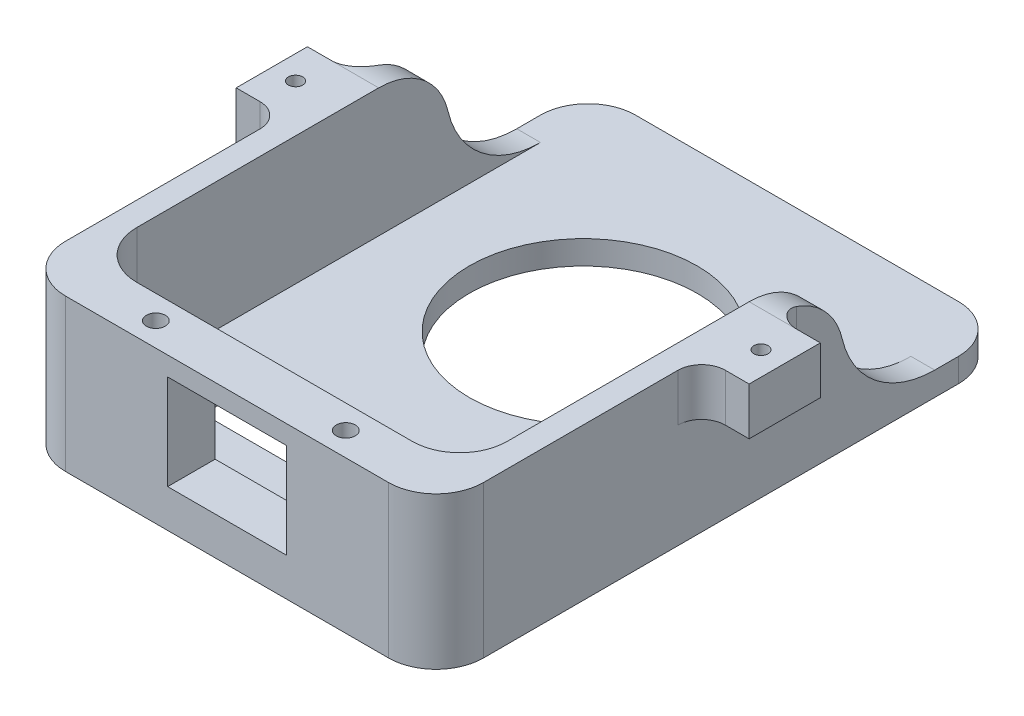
ISO-10303-21;
HEADER;
FILE_DESCRIPTION(('STEP AP214'),'2;1');
FILE_NAME('part.step','',(''),(''),'','','');
FILE_SCHEMA(('AUTOMOTIVE_DESIGN { 1 0 10303 214 1 1 1 1 }'));
ENDSEC;
DATA;
#1=APPLICATION_CONTEXT('core data for automotive mechanical design processes');
#2=APPLICATION_PROTOCOL_DEFINITION('international standard','automotive_design',2000,#1);
#3=PRODUCT_CONTEXT('',#1,'mechanical');
#4=PRODUCT('Part','Part','',(#3));
#5=PRODUCT_RELATED_PRODUCT_CATEGORY('part','',(#4));
#6=PRODUCT_DEFINITION_FORMATION('','',#4);
#7=PRODUCT_DEFINITION_CONTEXT('part definition',#1,'design');
#8=PRODUCT_DEFINITION('design','',#6,#7);
#9=PRODUCT_DEFINITION_SHAPE('','',#8);
#10=(LENGTH_UNIT() NAMED_UNIT(*) SI_UNIT(.MILLI.,.METRE.));
#11=(NAMED_UNIT(*) PLANE_ANGLE_UNIT() SI_UNIT($,.RADIAN.));
#12=(NAMED_UNIT(*) SI_UNIT($,.STERADIAN.) SOLID_ANGLE_UNIT());
#13=UNCERTAINTY_MEASURE_WITH_UNIT(LENGTH_MEASURE(1.E-05),#10,'distance_accuracy_value','');
#14=(GEOMETRIC_REPRESENTATION_CONTEXT(3) GLOBAL_UNCERTAINTY_ASSIGNED_CONTEXT((#13)) GLOBAL_UNIT_ASSIGNED_CONTEXT((#10,
#11,#12)) REPRESENTATION_CONTEXT('',''));
#15=CARTESIAN_POINT('',(0.,0.,0.));
#16=DIRECTION('',(0.,0.,1.));
#17=DIRECTION('',(1.,0.,0.));
#18=AXIS2_PLACEMENT_3D('',#15,#16,#17);
#19=CARTESIAN_POINT('',(44.,5.,-120.));
#20=DIRECTION('',(-1.,0.,0.));
#21=DIRECTION('',(0.,0.,1.));
#22=AXIS2_PLACEMENT_3D('',#19,#20,#21);
#23=PLANE('',#22);
#24=DIRECTION('',(0.,0.,-1.));
#25=VECTOR('',#24,1.);
#26=CARTESIAN_POINT('',(44.,0.,-120.));
#27=LINE('',#26,#25);
#28=CARTESIAN_POINT('',(44.,0.,-9.99999999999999));
#29=VERTEX_POINT('',#28);
#30=CARTESIAN_POINT('',(44.,0.,-110.));
#31=VERTEX_POINT('',#30);
#32=EDGE_CURVE('E433',#29,#31,#27,.T.);
#33=ORIENTED_EDGE('',*,*,#32,.T.);
#34=DIRECTION('',(0.,-1.,0.));
#35=VECTOR('',#34,1.);
#36=CARTESIAN_POINT('',(44.,5.,-110.));
#37=LINE('',#36,#35);
#38=CARTESIAN_POINT('',(44.,5.,-110.));
#39=VERTEX_POINT('',#38);
#40=EDGE_CURVE('E56',#31,#39,#37,.F.);
#41=ORIENTED_EDGE('',*,*,#40,.T.);
#42=DIRECTION('',(0.,0.,1.));
#43=VECTOR('',#42,1.);
#44=CARTESIAN_POINT('',(44.,5.,-120.));
#45=LINE('',#44,#43);
#46=CARTESIAN_POINT('',(44.,5.,-105.));
#47=VERTEX_POINT('',#46);
#48=EDGE_CURVE('E374',#39,#47,#45,.T.);
#49=ORIENTED_EDGE('',*,*,#48,.T.);
#50=CARTESIAN_POINT('',(44.,25.,-105.));
#51=DIRECTION('',(-1.,0.,0.));
#52=DIRECTION('',(0.,0.,1.));
#53=AXIS2_PLACEMENT_3D('',#50,#51,#52);
#54=CIRCLE('',#53,20.);
#55=CARTESIAN_POINT('',(44.,20.4285714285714,-85.5294571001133));
#56=VERTEX_POINT('',#55);
#57=EDGE_CURVE('E473',#47,#56,#54,.T.);
#58=ORIENTED_EDGE('',*,*,#57,.T.);
#59=CARTESIAN_POINT('',(44.,17.,-70.9265499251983));
#60=DIRECTION('',(-1.,0.,0.));
#61=DIRECTION('',(0.,0.,1.));
#62=AXIS2_PLACEMENT_3D('',#59,#60,#61);
#63=CIRCLE('',#62,15.);
#64=CARTESIAN_POINT('',(44.,31.142135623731,-75.9265499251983));
#65=VERTEX_POINT('',#64);
#66=EDGE_CURVE('E482',#56,#65,#63,.F.);
#67=ORIENTED_EDGE('',*,*,#66,.T.);
#68=DIRECTION('',(0.,1.,0.));
#69=VECTOR('',#68,1.);
#70=CARTESIAN_POINT('',(44.,22.,-75.9265499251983));
#71=LINE('',#70,#69);
#72=CARTESIAN_POINT('',(44.,22.,-75.9265499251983));
#73=VERTEX_POINT('',#72);
#74=EDGE_CURVE('E595',#65,#73,#71,.F.);
#75=ORIENTED_EDGE('',*,*,#74,.T.);
#76=DIRECTION('',(0.,0.,-1.));
#77=VECTOR('',#76,1.);
#78=CARTESIAN_POINT('',(44.,22.,-70.9265499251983));
#79=LINE('',#78,#77);
#80=CARTESIAN_POINT('',(44.,22.,-50.9265499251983));
#81=VERTEX_POINT('',#80);
#82=EDGE_CURVE('E320',#81,#73,#79,.T.);
#83=ORIENTED_EDGE('',*,*,#82,.F.);
#84=DIRECTION('',(0.,-1.,0.));
#85=VECTOR('',#84,1.);
#86=CARTESIAN_POINT('',(44.,32.,-50.9265499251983));
#87=LINE('',#86,#85);
#88=CARTESIAN_POINT('',(44.,32.,-50.9265499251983));
#89=VERTEX_POINT('',#88);
#90=EDGE_CURVE('E598',#81,#89,#87,.F.);
#91=ORIENTED_EDGE('',*,*,#90,.T.);
#92=DIRECTION('',(0.,0.,-1.));
#93=VECTOR('',#92,1.);
#94=CARTESIAN_POINT('',(44.,32.,-120.));
#95=LINE('',#94,#93);
#96=CARTESIAN_POINT('',(44.,32.,-9.99999999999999));
#97=VERTEX_POINT('',#96);
#98=EDGE_CURVE('E408',#97,#89,#95,.T.);
#99=ORIENTED_EDGE('',*,*,#98,.F.);
#100=DIRECTION('',(0.,-1.,0.));
#101=VECTOR('',#100,1.);
#102=CARTESIAN_POINT('',(44.,5.,-9.99999999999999));
#103=LINE('',#102,#101);
#104=EDGE_CURVE('E561',#97,#29,#103,.T.);
#105=ORIENTED_EDGE('',*,*,#104,.T.);
#106=EDGE_LOOP('',(#33,#41,#49,#58,#67,#75,#83,#91,#99,#105));
#107=FACE_BOUND('',#106,.T.);
#108=ADVANCED_FACE('F33',(#107),#23,.F.);
#109=CARTESIAN_POINT('',(-44.,5.,0.));
#110=DIRECTION('',(1.,0.,0.));
#111=DIRECTION('',(0.,0.,-1.));
#112=AXIS2_PLACEMENT_3D('',#109,#110,#111);
#113=PLANE('',#112);
#114=DIRECTION('',(0.,0.,-1.));
#115=VECTOR('',#114,1.);
#116=CARTESIAN_POINT('',(-44.,5.,0.));
#117=LINE('',#116,#115);
#118=CARTESIAN_POINT('',(-44.,5.,-105.));
#119=VERTEX_POINT('',#118);
#120=CARTESIAN_POINT('',(-44.,5.,-110.));
#121=VERTEX_POINT('',#120);
#122=EDGE_CURVE('E372',#119,#121,#117,.T.);
#123=ORIENTED_EDGE('',*,*,#122,.T.);
#124=DIRECTION('',(0.,-1.,0.));
#125=VECTOR('',#124,1.);
#126=CARTESIAN_POINT('',(-44.,5.,-110.));
#127=LINE('',#126,#125);
#128=CARTESIAN_POINT('',(-44.,0.,-110.));
#129=VERTEX_POINT('',#128);
#130=EDGE_CURVE('E745',#121,#129,#127,.T.);
#131=ORIENTED_EDGE('',*,*,#130,.T.);
#132=DIRECTION('',(0.,0.,1.));
#133=VECTOR('',#132,1.);
#134=CARTESIAN_POINT('',(-44.,0.,0.));
#135=LINE('',#134,#133);
#136=CARTESIAN_POINT('',(-44.,0.,-9.99999999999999));
#137=VERTEX_POINT('',#136);
#138=EDGE_CURVE('E419',#129,#137,#135,.T.);
#139=ORIENTED_EDGE('',*,*,#138,.T.);
#140=DIRECTION('',(0.,-1.,0.));
#141=VECTOR('',#140,1.);
#142=CARTESIAN_POINT('',(-44.,5.,-9.99999999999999));
#143=LINE('',#142,#141);
#144=CARTESIAN_POINT('',(-44.,32.,-9.99999999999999));
#145=VERTEX_POINT('',#144);
#146=EDGE_CURVE('E578',#137,#145,#143,.F.);
#147=ORIENTED_EDGE('',*,*,#146,.T.);
#148=DIRECTION('',(0.,0.,1.));
#149=VECTOR('',#148,1.);
#150=CARTESIAN_POINT('',(-44.,32.,0.));
#151=LINE('',#150,#149);
#152=CARTESIAN_POINT('',(-44.,32.,-50.9265499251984));
#153=VERTEX_POINT('',#152);
#154=EDGE_CURVE('E403',#153,#145,#151,.T.);
#155=ORIENTED_EDGE('',*,*,#154,.F.);
#156=DIRECTION('',(0.,1.,0.));
#157=VECTOR('',#156,1.);
#158=CARTESIAN_POINT('',(-44.,22.,-50.9265499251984));
#159=LINE('',#158,#157);
#160=CARTESIAN_POINT('',(-44.,22.,-50.9265499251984));
#161=VERTEX_POINT('',#160);
#162=EDGE_CURVE('E584',#153,#161,#159,.F.);
#163=ORIENTED_EDGE('',*,*,#162,.T.);
#164=DIRECTION('',(0.,0.,1.));
#165=VECTOR('',#164,1.);
#166=CARTESIAN_POINT('',(-44.,22.,-70.9265499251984));
#167=LINE('',#166,#165);
#168=CARTESIAN_POINT('',(-44.,22.,-75.9265499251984));
#169=VERTEX_POINT('',#168);
#170=EDGE_CURVE('E326',#169,#161,#167,.T.);
#171=ORIENTED_EDGE('',*,*,#170,.F.);
#172=DIRECTION('',(0.,-1.,0.));
#173=VECTOR('',#172,1.);
#174=CARTESIAN_POINT('',(-44.,32.,-75.9265499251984));
#175=LINE('',#174,#173);
#176=CARTESIAN_POINT('',(-44.,31.142135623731,-75.9265499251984));
#177=VERTEX_POINT('',#176);
#178=EDGE_CURVE('E587',#169,#177,#175,.F.);
#179=ORIENTED_EDGE('',*,*,#178,.T.);
#180=CARTESIAN_POINT('',(-44.,17.,-70.9265499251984));
#181=DIRECTION('',(1.,0.,0.));
#182=DIRECTION('',(0.,0.,-1.));
#183=AXIS2_PLACEMENT_3D('',#180,#181,#182);
#184=CIRCLE('',#183,15.);
#185=CARTESIAN_POINT('',(-44.,20.4285714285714,-85.5294571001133));
#186=VERTEX_POINT('',#185);
#187=EDGE_CURVE('E495',#177,#186,#184,.F.);
#188=ORIENTED_EDGE('',*,*,#187,.T.);
#189=CARTESIAN_POINT('',(-44.,25.,-105.));
#190=DIRECTION('',(1.,0.,0.));
#191=DIRECTION('',(0.,0.,-1.));
#192=AXIS2_PLACEMENT_3D('',#189,#190,#191);
#193=CIRCLE('',#192,20.);
#194=EDGE_CURVE('E491',#186,#119,#193,.T.);
#195=ORIENTED_EDGE('',*,*,#194,.T.);
#196=EDGE_LOOP('',(#123,#131,#139,#147,#155,#163,#171,#179,#188,#195));
#197=FACE_BOUND('',#196,.T.);
#198=ADVANCED_FACE('F670',(#197),#113,.F.);
#199=CARTESIAN_POINT('',(0.,5.,0.));
#200=DIRECTION('',(0.,-1.,0.));
#201=DIRECTION('',(0.,0.,-1.));
#202=AXIS2_PLACEMENT_3D('',#199,#200,#201);
#203=PLANE('',#202);
#204=DIRECTION('',(-1.,0.,0.));
#205=VECTOR('',#204,1.);
#206=CARTESIAN_POINT('',(30.,5.,-35.));
#207=LINE('',#206,#205);
#208=CARTESIAN_POINT('',(25.,5.,-35.));
#209=VERTEX_POINT('',#208);
#210=CARTESIAN_POINT('',(-25.,5.,-35.));
#211=VERTEX_POINT('',#210);
#212=EDGE_CURVE('E363',#209,#211,#207,.T.);
#213=ORIENTED_EDGE('',*,*,#212,.F.);
#214=CARTESIAN_POINT('',(25.,5.,-30.));
#215=DIRECTION('',(0.,-1.,0.));
#216=DIRECTION('',(0.,0.,-1.));
#217=AXIS2_PLACEMENT_3D('',#214,#215,#216);
#218=CIRCLE('',#217,5.);
#219=CARTESIAN_POINT('',(30.,5.,-30.));
#220=VERTEX_POINT('',#219);
#221=EDGE_CURVE('E533',#209,#220,#218,.T.);
#222=ORIENTED_EDGE('',*,*,#221,.T.);
#223=DIRECTION('',(0.,0.,-1.));
#224=VECTOR('',#223,1.);
#225=CARTESIAN_POINT('',(30.,5.,-20.));
#226=LINE('',#225,#224);
#227=CARTESIAN_POINT('',(30.,5.,-25.));
#228=VERTEX_POINT('',#227);
#229=EDGE_CURVE('E360',#228,#220,#226,.T.);
#230=ORIENTED_EDGE('',*,*,#229,.F.);
#231=CARTESIAN_POINT('',(25.,5.,-25.));
#232=DIRECTION('',(0.,-1.,0.));
#233=DIRECTION('',(0.,0.,-1.));
#234=AXIS2_PLACEMENT_3D('',#231,#232,#233);
#235=CIRCLE('',#234,5.);
#236=CARTESIAN_POINT('',(25.,5.,-20.));
#237=VERTEX_POINT('',#236);
#238=EDGE_CURVE('E545',#228,#237,#235,.T.);
#239=ORIENTED_EDGE('',*,*,#238,.T.);
#240=DIRECTION('',(1.,0.,0.));
#241=VECTOR('',#240,1.);
#242=CARTESIAN_POINT('',(30.,5.,-20.));
#243=LINE('',#242,#241);
#244=CARTESIAN_POINT('',(-25.,5.,-20.));
#245=VERTEX_POINT('',#244);
#246=EDGE_CURVE('E369',#245,#237,#243,.T.);
#247=ORIENTED_EDGE('',*,*,#246,.F.);
#248=CARTESIAN_POINT('',(-25.,5.,-25.));
#249=DIRECTION('',(0.,-1.,0.));
#250=DIRECTION('',(0.,0.,-1.));
#251=AXIS2_PLACEMENT_3D('',#248,#249,#250);
#252=CIRCLE('',#251,5.);
#253=CARTESIAN_POINT('',(-30.,5.,-25.));
#254=VERTEX_POINT('',#253);
#255=EDGE_CURVE('E541',#245,#254,#252,.T.);
#256=ORIENTED_EDGE('',*,*,#255,.T.);
#257=DIRECTION('',(0.,0.,1.));
#258=VECTOR('',#257,1.);
#259=CARTESIAN_POINT('',(-30.,5.,-20.));
#260=LINE('',#259,#258);
#261=CARTESIAN_POINT('',(-30.,5.,-30.));
#262=VERTEX_POINT('',#261);
#263=EDGE_CURVE('E366',#262,#254,#260,.T.);
#264=ORIENTED_EDGE('',*,*,#263,.F.);
#265=CARTESIAN_POINT('',(-25.,5.,-30.));
#266=DIRECTION('',(0.,-1.,0.));
#267=DIRECTION('',(0.,0.,-1.));
#268=AXIS2_PLACEMENT_3D('',#265,#266,#267);
#269=CIRCLE('',#268,5.);
#270=EDGE_CURVE('E537',#262,#211,#269,.T.);
#271=ORIENTED_EDGE('',*,*,#270,.T.);
#272=EDGE_LOOP('',(#213,#222,#230,#239,#247,#256,#264,#271));
#273=FACE_BOUND('',#272,.T.);
#274=CARTESIAN_POINT('',(0.,5.,-75.));
#275=DIRECTION('',(0.,-1.,0.));
#276=DIRECTION('',(0.,0.,-1.));
#277=AXIS2_PLACEMENT_3D('',#274,#275,#276);
#278=CIRCLE('',#277,24.);
#279=CARTESIAN_POINT('',(0.,5.,-99.));
#280=VERTEX_POINT('',#279);
#281=EDGE_CURVE('E379',#280,#280,#278,.T.);
#282=ORIENTED_EDGE('',*,*,#281,.T.);
#283=EDGE_LOOP('',(#282));
#284=FACE_BOUND('',#283,.T.);
#285=ORIENTED_EDGE('',*,*,#48,.F.);
#286=CARTESIAN_POINT('',(34.,5.,-110.));
#287=DIRECTION('',(0.,-1.,0.));
#288=DIRECTION('',(0.,0.,-1.));
#289=AXIS2_PLACEMENT_3D('',#286,#287,#288);
#290=CIRCLE('',#289,10.);
#291=CARTESIAN_POINT('',(34.,5.,-120.));
#292=VERTEX_POINT('',#291);
#293=EDGE_CURVE('E749',#39,#292,#290,.F.);
#294=ORIENTED_EDGE('',*,*,#293,.T.);
#295=DIRECTION('',(-1.,0.,0.));
#296=VECTOR('',#295,1.);
#297=CARTESIAN_POINT('',(-44.,5.,-120.));
#298=LINE('',#297,#296);
#299=CARTESIAN_POINT('',(-34.,5.,-120.));
#300=VERTEX_POINT('',#299);
#301=EDGE_CURVE('E425',#292,#300,#298,.T.);
#302=ORIENTED_EDGE('',*,*,#301,.T.);
#303=CARTESIAN_POINT('',(-34.,5.,-110.));
#304=DIRECTION('',(0.,-1.,0.));
#305=DIRECTION('',(0.,0.,-1.));
#306=AXIS2_PLACEMENT_3D('',#303,#304,#305);
#307=CIRCLE('',#306,10.);
#308=EDGE_CURVE('E48',#300,#121,#307,.F.);
#309=ORIENTED_EDGE('',*,*,#308,.T.);
#310=ORIENTED_EDGE('',*,*,#122,.F.);
#311=DIRECTION('',(1.,0.,0.));
#312=VECTOR('',#311,1.);
#313=CARTESIAN_POINT('',(-39.,5.,-105.));
#314=LINE('',#313,#312);
#315=CARTESIAN_POINT('',(-39.,5.,-105.));
#316=VERTEX_POINT('',#315);
#317=EDGE_CURVE('E485',#119,#316,#314,.T.);
#318=ORIENTED_EDGE('',*,*,#317,.T.);
#319=DIRECTION('',(0.,0.,-1.));
#320=VECTOR('',#319,1.);
#321=CARTESIAN_POINT('',(-39.,5.,-120.));
#322=LINE('',#321,#320);
#323=CARTESIAN_POINT('',(-39.,5.,-20.));
#324=VERTEX_POINT('',#323);
#325=EDGE_CURVE('E406',#324,#316,#322,.T.);
#326=ORIENTED_EDGE('',*,*,#325,.F.);
#327=CARTESIAN_POINT('',(-29.,5.,-20.));
#328=DIRECTION('',(0.,-1.,0.));
#329=DIRECTION('',(0.,0.,-1.));
#330=AXIS2_PLACEMENT_3D('',#327,#328,#329);
#331=CIRCLE('',#330,10.);
#332=CARTESIAN_POINT('',(-29.,5.,-9.99999999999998));
#333=VERTEX_POINT('',#332);
#334=EDGE_CURVE('E441',#324,#333,#331,.F.);
#335=ORIENTED_EDGE('',*,*,#334,.T.);
#336=DIRECTION('',(-1.,0.,0.));
#337=VECTOR('',#336,1.);
#338=CARTESIAN_POINT('',(-39.,5.,-9.99999999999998));
#339=LINE('',#338,#337);
#340=CARTESIAN_POINT('',(29.,5.,-9.99999999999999));
#341=VERTEX_POINT('',#340);
#342=EDGE_CURVE('E421',#341,#333,#339,.T.);
#343=ORIENTED_EDGE('',*,*,#342,.F.);
#344=CARTESIAN_POINT('',(29.,5.,-20.));
#345=DIRECTION('',(0.,-1.,0.));
#346=DIRECTION('',(0.,0.,-1.));
#347=AXIS2_PLACEMENT_3D('',#344,#345,#346);
#348=CIRCLE('',#347,10.);
#349=CARTESIAN_POINT('',(39.,5.,-20.));
#350=VERTEX_POINT('',#349);
#351=EDGE_CURVE('E443',#341,#350,#348,.F.);
#352=ORIENTED_EDGE('',*,*,#351,.T.);
#353=DIRECTION('',(0.,0.,1.));
#354=VECTOR('',#353,1.);
#355=CARTESIAN_POINT('',(39.,5.,-9.99999999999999));
#356=LINE('',#355,#354);
#357=CARTESIAN_POINT('',(39.,5.,-105.));
#358=VERTEX_POINT('',#357);
#359=EDGE_CURVE('E396',#358,#350,#356,.T.);
#360=ORIENTED_EDGE('',*,*,#359,.F.);
#361=DIRECTION('',(-1.,0.,0.));
#362=VECTOR('',#361,1.);
#363=CARTESIAN_POINT('',(44.,5.,-105.));
#364=LINE('',#363,#362);
#365=EDGE_CURVE('E468',#358,#47,#364,.F.);
#366=ORIENTED_EDGE('',*,*,#365,.T.);
#367=EDGE_LOOP('',(#285,#294,#302,#309,#310,#318,#326,#335,#343,#352,#360,#366));
#368=FACE_BOUND('',#367,.T.);
#369=ADVANCED_FACE('F676',(#273,#284,#368),#203,.F.);
#370=CARTESIAN_POINT('',(44.,5.,0.));
#371=DIRECTION('',(0.,0.,-1.));
#372=DIRECTION('',(-1.,0.,0.));
#373=AXIS2_PLACEMENT_3D('',#370,#371,#372);
#374=PLANE('',#373);
#375=DIRECTION('',(1.,0.,0.));
#376=VECTOR('',#375,1.);
#377=CARTESIAN_POINT('',(-12.5,8.,0.));
#378=LINE('',#377,#376);
#379=CARTESIAN_POINT('',(-12.5,8.,0.));
#380=VERTEX_POINT('',#379);
#381=CARTESIAN_POINT('',(12.5,8.,0.));
#382=VERTEX_POINT('',#381);
#383=EDGE_CURVE('E384',#380,#382,#378,.T.);
#384=ORIENTED_EDGE('',*,*,#383,.F.);
#385=DIRECTION('',(0.,-1.,0.));
#386=VECTOR('',#385,1.);
#387=CARTESIAN_POINT('',(-12.5,8.,0.));
#388=LINE('',#387,#386);
#389=CARTESIAN_POINT('',(-12.5,28.,0.));
#390=VERTEX_POINT('',#389);
#391=EDGE_CURVE('E382',#390,#380,#388,.T.);
#392=ORIENTED_EDGE('',*,*,#391,.F.);
#393=DIRECTION('',(-1.,0.,0.));
#394=VECTOR('',#393,1.);
#395=CARTESIAN_POINT('',(-12.5,28.,0.));
#396=LINE('',#395,#394);
#397=CARTESIAN_POINT('',(12.5,28.,0.));
#398=VERTEX_POINT('',#397);
#399=EDGE_CURVE('E390',#398,#390,#396,.T.);
#400=ORIENTED_EDGE('',*,*,#399,.F.);
#401=DIRECTION('',(0.,1.,0.));
#402=VECTOR('',#401,1.);
#403=CARTESIAN_POINT('',(12.5,8.,0.));
#404=LINE('',#403,#402);
#405=EDGE_CURVE('E387',#382,#398,#404,.T.);
#406=ORIENTED_EDGE('',*,*,#405,.F.);
#407=EDGE_LOOP('',(#384,#392,#400,#406));
#408=FACE_BOUND('',#407,.T.);
#409=DIRECTION('',(1.,0.,0.));
#410=VECTOR('',#409,1.);
#411=CARTESIAN_POINT('',(44.,0.,0.));
#412=LINE('',#411,#410);
#413=CARTESIAN_POINT('',(-34.,0.,0.));
#414=VERTEX_POINT('',#413);
#415=CARTESIAN_POINT('',(34.,0.,0.));
#416=VERTEX_POINT('',#415);
#417=EDGE_CURVE('E430',#414,#416,#412,.T.);
#418=ORIENTED_EDGE('',*,*,#417,.T.);
#419=DIRECTION('',(0.,-1.,0.));
#420=VECTOR('',#419,1.);
#421=CARTESIAN_POINT('',(34.,5.,0.));
#422=LINE('',#421,#420);
#423=CARTESIAN_POINT('',(34.,32.,0.));
#424=VERTEX_POINT('',#423);
#425=EDGE_CURVE('E572',#416,#424,#422,.F.);
#426=ORIENTED_EDGE('',*,*,#425,.T.);
#427=DIRECTION('',(1.,0.,0.));
#428=VECTOR('',#427,1.);
#429=CARTESIAN_POINT('',(44.,32.,0.));
#430=LINE('',#429,#428);
#431=CARTESIAN_POINT('',(-34.,32.,0.));
#432=VERTEX_POINT('',#431);
#433=EDGE_CURVE('E405',#432,#424,#430,.T.);
#434=ORIENTED_EDGE('',*,*,#433,.F.);
#435=DIRECTION('',(0.,-1.,0.));
#436=VECTOR('',#435,1.);
#437=CARTESIAN_POINT('',(-34.,5.,0.));
#438=LINE('',#437,#436);
#439=EDGE_CURVE('E569',#432,#414,#438,.T.);
#440=ORIENTED_EDGE('',*,*,#439,.T.);
#441=EDGE_LOOP('',(#418,#426,#434,#440));
#442=FACE_BOUND('',#441,.T.);
#443=ADVANCED_FACE('F683',(#408,#442),#374,.F.);
#444=CARTESIAN_POINT('',(-44.,5.,-120.));
#445=DIRECTION('',(0.,0.,1.));
#446=DIRECTION('',(1.,0.,0.));
#447=AXIS2_PLACEMENT_3D('',#444,#445,#446);
#448=PLANE('',#447);
#449=ORIENTED_EDGE('',*,*,#301,.F.);
#450=DIRECTION('',(0.,-1.,0.));
#451=VECTOR('',#450,1.);
#452=CARTESIAN_POINT('',(34.,5.,-120.));
#453=LINE('',#452,#451);
#454=CARTESIAN_POINT('',(34.,0.,-120.));
#455=VERTEX_POINT('',#454);
#456=EDGE_CURVE('E805',#292,#455,#453,.T.);
#457=ORIENTED_EDGE('',*,*,#456,.T.);
#458=DIRECTION('',(-1.,0.,0.));
#459=VECTOR('',#458,1.);
#460=CARTESIAN_POINT('',(-44.,0.,-120.));
#461=LINE('',#460,#459);
#462=CARTESIAN_POINT('',(-34.,0.,-120.));
#463=VERTEX_POINT('',#462);
#464=EDGE_CURVE('E428',#455,#463,#461,.T.);
#465=ORIENTED_EDGE('',*,*,#464,.T.);
#466=DIRECTION('',(0.,-1.,0.));
#467=VECTOR('',#466,1.);
#468=CARTESIAN_POINT('',(-34.,5.,-120.));
#469=LINE('',#468,#467);
#470=EDGE_CURVE('E801',#463,#300,#469,.F.);
#471=ORIENTED_EDGE('',*,*,#470,.T.);
#472=EDGE_LOOP('',(#449,#457,#465,#471));
#473=FACE_BOUND('',#472,.T.);
#474=ADVANCED_FACE('F681',(#473),#448,.F.);
#475=CARTESIAN_POINT('',(0.,0.,0.));
#476=DIRECTION('',(0.,-1.,0.));
#477=DIRECTION('',(0.,0.,-1.));
#478=AXIS2_PLACEMENT_3D('',#475,#476,#477);
#479=PLANE('',#478);
#480=CARTESIAN_POINT('',(20.,0.,-4.99999999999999));
#481=DIRECTION('',(0.,-1.,0.));
#482=DIRECTION('',(0.,0.,-1.));
#483=AXIS2_PLACEMENT_3D('',#480,#481,#482);
#484=CIRCLE('',#483,4.49999999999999);
#485=CARTESIAN_POINT('',(20.,0.,-9.49999999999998));
#486=VERTEX_POINT('',#485);
#487=EDGE_CURVE('E552',#486,#486,#484,.F.);
#488=ORIENTED_EDGE('',*,*,#487,.T.);
#489=EDGE_LOOP('',(#488));
#490=FACE_BOUND('',#489,.T.);
#491=CARTESIAN_POINT('',(-20.,0.,-4.99999999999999));
#492=DIRECTION('',(0.,-1.,0.));
#493=DIRECTION('',(0.,0.,-1.));
#494=AXIS2_PLACEMENT_3D('',#491,#492,#493);
#495=CIRCLE('',#494,4.49999999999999);
#496=CARTESIAN_POINT('',(-20.,0.,-9.49999999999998));
#497=VERTEX_POINT('',#496);
#498=EDGE_CURVE('E549',#497,#497,#495,.F.);
#499=ORIENTED_EDGE('',*,*,#498,.T.);
#500=EDGE_LOOP('',(#499));
#501=FACE_BOUND('',#500,.T.);
#502=DIRECTION('',(0.,0.,1.));
#503=VECTOR('',#502,1.);
#504=CARTESIAN_POINT('',(30.,0.,0.));
#505=LINE('',#504,#503);
#506=CARTESIAN_POINT('',(30.,0.,-30.));
#507=VERTEX_POINT('',#506);
#508=CARTESIAN_POINT('',(30.,0.,-25.));
#509=VERTEX_POINT('',#508);
#510=EDGE_CURVE('E510',#507,#509,#505,.T.);
#511=ORIENTED_EDGE('',*,*,#510,.F.);
#512=CARTESIAN_POINT('',(25.,0.,-30.));
#513=DIRECTION('',(0.,-1.,0.));
#514=DIRECTION('',(0.,0.,-1.));
#515=AXIS2_PLACEMENT_3D('',#512,#513,#514);
#516=CIRCLE('',#515,5.);
#517=CARTESIAN_POINT('',(25.,0.,-35.));
#518=VERTEX_POINT('',#517);
#519=EDGE_CURVE('E535',#507,#518,#516,.F.);
#520=ORIENTED_EDGE('',*,*,#519,.T.);
#521=DIRECTION('',(1.,0.,0.));
#522=VECTOR('',#521,1.);
#523=CARTESIAN_POINT('',(0.,0.,-35.));
#524=LINE('',#523,#522);
#525=CARTESIAN_POINT('',(-25.,0.,-35.));
#526=VERTEX_POINT('',#525);
#527=EDGE_CURVE('E501',#526,#518,#524,.T.);
#528=ORIENTED_EDGE('',*,*,#527,.F.);
#529=CARTESIAN_POINT('',(-25.,0.,-30.));
#530=DIRECTION('',(0.,-1.,0.));
#531=DIRECTION('',(0.,0.,-1.));
#532=AXIS2_PLACEMENT_3D('',#529,#530,#531);
#533=CIRCLE('',#532,5.);
#534=CARTESIAN_POINT('',(-30.,0.,-30.));
#535=VERTEX_POINT('',#534);
#536=EDGE_CURVE('E539',#526,#535,#533,.F.);
#537=ORIENTED_EDGE('',*,*,#536,.T.);
#538=DIRECTION('',(0.,0.,-1.));
#539=VECTOR('',#538,1.);
#540=CARTESIAN_POINT('',(-30.,0.,0.));
#541=LINE('',#540,#539);
#542=CARTESIAN_POINT('',(-30.,0.,-25.));
#543=VERTEX_POINT('',#542);
#544=EDGE_CURVE('E504',#543,#535,#541,.T.);
#545=ORIENTED_EDGE('',*,*,#544,.F.);
#546=CARTESIAN_POINT('',(-25.,0.,-25.));
#547=DIRECTION('',(0.,-1.,0.));
#548=DIRECTION('',(0.,0.,-1.));
#549=AXIS2_PLACEMENT_3D('',#546,#547,#548);
#550=CIRCLE('',#549,5.);
#551=CARTESIAN_POINT('',(-25.,0.,-20.));
#552=VERTEX_POINT('',#551);
#553=EDGE_CURVE('E543',#543,#552,#550,.F.);
#554=ORIENTED_EDGE('',*,*,#553,.T.);
#555=DIRECTION('',(-1.,0.,0.));
#556=VECTOR('',#555,1.);
#557=CARTESIAN_POINT('',(0.,0.,-20.));
#558=LINE('',#557,#556);
#559=CARTESIAN_POINT('',(25.,0.,-20.));
#560=VERTEX_POINT('',#559);
#561=EDGE_CURVE('E507',#560,#552,#558,.T.);
#562=ORIENTED_EDGE('',*,*,#561,.F.);
#563=CARTESIAN_POINT('',(25.,0.,-25.));
#564=DIRECTION('',(0.,-1.,0.));
#565=DIRECTION('',(0.,0.,-1.));
#566=AXIS2_PLACEMENT_3D('',#563,#564,#565);
#567=CIRCLE('',#566,5.);
#568=EDGE_CURVE('E547',#560,#509,#567,.F.);
#569=ORIENTED_EDGE('',*,*,#568,.T.);
#570=EDGE_LOOP('',(#511,#520,#528,#537,#545,#554,#562,#569));
#571=FACE_BOUND('',#570,.T.);
#572=CARTESIAN_POINT('',(0.,0.,-75.));
#573=DIRECTION('',(0.,-1.,0.));
#574=DIRECTION('',(0.,0.,-1.));
#575=AXIS2_PLACEMENT_3D('',#572,#573,#574);
#576=CIRCLE('',#575,24.);
#577=CARTESIAN_POINT('',(0.,0.,-99.));
#578=VERTEX_POINT('',#577);
#579=EDGE_CURVE('E376',#578,#578,#576,.T.);
#580=ORIENTED_EDGE('',*,*,#579,.F.);
#581=EDGE_LOOP('',(#580));
#582=FACE_BOUND('',#581,.T.);
#583=ORIENTED_EDGE('',*,*,#464,.F.);
#584=CARTESIAN_POINT('',(34.,0.,-110.));
#585=DIRECTION('',(0.,-1.,0.));
#586=DIRECTION('',(0.,0.,-1.));
#587=AXIS2_PLACEMENT_3D('',#584,#585,#586);
#588=CIRCLE('',#587,10.);
#589=EDGE_CURVE('E804',#455,#31,#588,.T.);
#590=ORIENTED_EDGE('',*,*,#589,.T.);
#591=ORIENTED_EDGE('',*,*,#32,.F.);
#592=CARTESIAN_POINT('',(34.,0.,-9.99999999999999));
#593=DIRECTION('',(0.,-1.,0.));
#594=DIRECTION('',(0.,0.,-1.));
#595=AXIS2_PLACEMENT_3D('',#592,#593,#594);
#596=CIRCLE('',#595,10.);
#597=EDGE_CURVE('E567',#29,#416,#596,.T.);
#598=ORIENTED_EDGE('',*,*,#597,.T.);
#599=ORIENTED_EDGE('',*,*,#417,.F.);
#600=CARTESIAN_POINT('',(-34.,0.,-9.99999999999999));
#601=DIRECTION('',(0.,-1.,0.));
#602=DIRECTION('',(0.,0.,-1.));
#603=AXIS2_PLACEMENT_3D('',#600,#601,#602);
#604=CIRCLE('',#603,10.);
#605=EDGE_CURVE('E564',#414,#137,#604,.T.);
#606=ORIENTED_EDGE('',*,*,#605,.T.);
#607=ORIENTED_EDGE('',*,*,#138,.F.);
#608=CARTESIAN_POINT('',(-34.,0.,-110.));
#609=DIRECTION('',(0.,-1.,0.));
#610=DIRECTION('',(0.,0.,-1.));
#611=AXIS2_PLACEMENT_3D('',#608,#609,#610);
#612=CIRCLE('',#611,10.);
#613=EDGE_CURVE('E800',#129,#463,#612,.T.);
#614=ORIENTED_EDGE('',*,*,#613,.T.);
#615=EDGE_LOOP('',(#583,#590,#591,#598,#599,#606,#607,#614));
#616=FACE_BOUND('',#615,.T.);
#617=ADVANCED_FACE('F817',(#490,#501,#571,#582,#616),#479,.T.);
#618=CARTESIAN_POINT('',(39.,32.,-9.99999999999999));
#619=DIRECTION('',(1.,0.,0.));
#620=DIRECTION('',(0.,0.,-1.));
#621=AXIS2_PLACEMENT_3D('',#618,#619,#620);
#622=PLANE('',#621);
#623=DIRECTION('',(0.,0.,1.));
#624=VECTOR('',#623,1.);
#625=CARTESIAN_POINT('',(39.,32.,-9.99999999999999));
#626=LINE('',#625,#624);
#627=CARTESIAN_POINT('',(39.,32.,-70.9265499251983));
#628=VERTEX_POINT('',#627);
#629=CARTESIAN_POINT('',(39.,32.,-20.));
#630=VERTEX_POINT('',#629);
#631=EDGE_CURVE('E411',#628,#630,#626,.T.);
#632=ORIENTED_EDGE('',*,*,#631,.F.);
#633=CARTESIAN_POINT('',(39.,17.,-70.9265499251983));
#634=DIRECTION('',(1.,0.,0.));
#635=DIRECTION('',(0.,0.,-1.));
#636=AXIS2_PLACEMENT_3D('',#633,#634,#635);
#637=CIRCLE('',#636,15.);
#638=CARTESIAN_POINT('',(39.,20.4285714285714,-85.5294571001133));
#639=VERTEX_POINT('',#638);
#640=EDGE_CURVE('E478',#628,#639,#637,.F.);
#641=ORIENTED_EDGE('',*,*,#640,.T.);
#642=CARTESIAN_POINT('',(39.,25.,-105.));
#643=DIRECTION('',(1.,0.,0.));
#644=DIRECTION('',(0.,0.,-1.));
#645=AXIS2_PLACEMENT_3D('',#642,#643,#644);
#646=CIRCLE('',#645,20.);
#647=EDGE_CURVE('E471',#639,#358,#646,.T.);
#648=ORIENTED_EDGE('',*,*,#647,.T.);
#649=ORIENTED_EDGE('',*,*,#359,.T.);
#650=DIRECTION('',(0.,-1.,0.));
#651=VECTOR('',#650,1.);
#652=CARTESIAN_POINT('',(39.,32.,-20.));
#653=LINE('',#652,#651);
#654=EDGE_CURVE('E446',#350,#630,#653,.F.);
#655=ORIENTED_EDGE('',*,*,#654,.T.);
#656=EDGE_LOOP('',(#632,#641,#648,#649,#655));
#657=FACE_BOUND('',#656,.T.);
#658=ADVANCED_FACE('F907',(#657),#622,.F.);
#659=CARTESIAN_POINT('',(-39.,32.,-9.99999999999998));
#660=DIRECTION('',(0.,0.,1.));
#661=DIRECTION('',(1.,0.,0.));
#662=AXIS2_PLACEMENT_3D('',#659,#660,#661);
#663=PLANE('',#662);
#664=DIRECTION('',(-1.,0.,0.));
#665=VECTOR('',#664,1.);
#666=CARTESIAN_POINT('',(-39.,28.,-9.99999999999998));
#667=LINE('',#666,#665);
#668=CARTESIAN_POINT('',(12.5,28.,-10.));
#669=VERTEX_POINT('',#668);
#670=CARTESIAN_POINT('',(-12.5,28.,-10.));
#671=VERTEX_POINT('',#670);
#672=EDGE_CURVE('E462',#669,#671,#667,.T.);
#673=ORIENTED_EDGE('',*,*,#672,.T.);
#674=DIRECTION('',(0.,-1.,0.));
#675=VECTOR('',#674,1.);
#676=CARTESIAN_POINT('',(-12.5,32.,-9.99999999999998));
#677=LINE('',#676,#675);
#678=CARTESIAN_POINT('',(-12.5,8.,-10.));
#679=VERTEX_POINT('',#678);
#680=EDGE_CURVE('E465',#671,#679,#677,.T.);
#681=ORIENTED_EDGE('',*,*,#680,.T.);
#682=DIRECTION('',(1.,0.,0.));
#683=VECTOR('',#682,1.);
#684=CARTESIAN_POINT('',(-39.,8.,-9.99999999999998));
#685=LINE('',#684,#683);
#686=CARTESIAN_POINT('',(12.5,8.,-9.99999999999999));
#687=VERTEX_POINT('',#686);
#688=EDGE_CURVE('E456',#679,#687,#685,.T.);
#689=ORIENTED_EDGE('',*,*,#688,.T.);
#690=DIRECTION('',(0.,1.,0.));
#691=VECTOR('',#690,1.);
#692=CARTESIAN_POINT('',(12.5,32.,-9.99999999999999));
#693=LINE('',#692,#691);
#694=EDGE_CURVE('E459',#687,#669,#693,.T.);
#695=ORIENTED_EDGE('',*,*,#694,.T.);
#696=EDGE_LOOP('',(#673,#681,#689,#695));
#697=FACE_BOUND('',#696,.T.);
#698=DIRECTION('',(-1.,0.,0.));
#699=VECTOR('',#698,1.);
#700=CARTESIAN_POINT('',(-39.,32.,-9.99999999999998));
#701=LINE('',#700,#699);
#702=CARTESIAN_POINT('',(29.,32.,-9.99999999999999));
#703=VERTEX_POINT('',#702);
#704=CARTESIAN_POINT('',(-29.,32.,-9.99999999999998));
#705=VERTEX_POINT('',#704);
#706=EDGE_CURVE('E413',#703,#705,#701,.T.);
#707=ORIENTED_EDGE('',*,*,#706,.F.);
#708=DIRECTION('',(0.,-1.,0.));
#709=VECTOR('',#708,1.);
#710=CARTESIAN_POINT('',(29.,5.,-9.99999999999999));
#711=LINE('',#710,#709);
#712=EDGE_CURVE('E438',#703,#341,#711,.T.);
#713=ORIENTED_EDGE('',*,*,#712,.T.);
#714=ORIENTED_EDGE('',*,*,#342,.T.);
#715=DIRECTION('',(0.,-1.,0.));
#716=VECTOR('',#715,1.);
#717=CARTESIAN_POINT('',(-29.,32.,-9.99999999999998));
#718=LINE('',#717,#716);
#719=EDGE_CURVE('E427',#333,#705,#718,.F.);
#720=ORIENTED_EDGE('',*,*,#719,.T.);
#721=EDGE_LOOP('',(#707,#713,#714,#720));
#722=FACE_BOUND('',#721,.T.);
#723=ADVANCED_FACE('F904',(#697,#722),#663,.F.);
#724=CARTESIAN_POINT('',(-39.,32.,-120.));
#725=DIRECTION('',(-1.,0.,0.));
#726=DIRECTION('',(0.,0.,1.));
#727=AXIS2_PLACEMENT_3D('',#724,#725,#726);
#728=PLANE('',#727);
#729=CARTESIAN_POINT('',(-39.,25.,-105.));
#730=DIRECTION('',(-1.,0.,0.));
#731=DIRECTION('',(0.,0.,1.));
#732=AXIS2_PLACEMENT_3D('',#729,#730,#731);
#733=CIRCLE('',#732,20.);
#734=CARTESIAN_POINT('',(-39.,20.4285714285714,-85.5294571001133));
#735=VERTEX_POINT('',#734);
#736=EDGE_CURVE('E488',#316,#735,#733,.T.);
#737=ORIENTED_EDGE('',*,*,#736,.T.);
#738=CARTESIAN_POINT('',(-39.,17.,-70.9265499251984));
#739=DIRECTION('',(-1.,0.,0.));
#740=DIRECTION('',(0.,0.,1.));
#741=AXIS2_PLACEMENT_3D('',#738,#739,#740);
#742=CIRCLE('',#741,15.);
#743=CARTESIAN_POINT('',(-39.,32.,-70.9265499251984));
#744=VERTEX_POINT('',#743);
#745=EDGE_CURVE('E499',#735,#744,#742,.F.);
#746=ORIENTED_EDGE('',*,*,#745,.T.);
#747=DIRECTION('',(0.,0.,-1.));
#748=VECTOR('',#747,1.);
#749=CARTESIAN_POINT('',(-39.,32.,-120.));
#750=LINE('',#749,#748);
#751=CARTESIAN_POINT('',(-39.,32.,-20.));
#752=VERTEX_POINT('',#751);
#753=EDGE_CURVE('E416',#752,#744,#750,.T.);
#754=ORIENTED_EDGE('',*,*,#753,.F.);
#755=DIRECTION('',(0.,-1.,0.));
#756=VECTOR('',#755,1.);
#757=CARTESIAN_POINT('',(-39.,5.,-20.));
#758=LINE('',#757,#756);
#759=EDGE_CURVE('E449',#752,#324,#758,.T.);
#760=ORIENTED_EDGE('',*,*,#759,.T.);
#761=ORIENTED_EDGE('',*,*,#325,.T.);
#762=EDGE_LOOP('',(#737,#746,#754,#760,#761));
#763=FACE_BOUND('',#762,.T.);
#764=ADVANCED_FACE('F792',(#763),#728,.F.);
#765=CARTESIAN_POINT('',(0.,32.,0.));
#766=DIRECTION('',(0.,-1.,0.));
#767=DIRECTION('',(0.,0.,-1.));
#768=AXIS2_PLACEMENT_3D('',#765,#766,#767);
#769=PLANE('',#768);
#770=CARTESIAN_POINT('',(-49.,32.,-63.4265499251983));
#771=DIRECTION('',(0.,1.,0.));
#772=DIRECTION('',(0.,0.,1.));
#773=AXIS2_PLACEMENT_3D('',#770,#771,#772);
#774=CIRCLE('',#773,1.5);
#775=CARTESIAN_POINT('',(-49.,32.,-61.9265499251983));
#776=VERTEX_POINT('',#775);
#777=EDGE_CURVE('E846',#776,#776,#774,.T.);
#778=ORIENTED_EDGE('',*,*,#777,.F.);
#779=EDGE_LOOP('',(#778));
#780=FACE_BOUND('',#779,.T.);
#781=CARTESIAN_POINT('',(49.,32.,-63.4265499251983));
#782=DIRECTION('',(0.,1.,0.));
#783=DIRECTION('',(0.,0.,1.));
#784=AXIS2_PLACEMENT_3D('',#781,#782,#783);
#785=CIRCLE('',#784,1.5);
#786=CARTESIAN_POINT('',(49.,32.,-61.9265499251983));
#787=VERTEX_POINT('',#786);
#788=EDGE_CURVE('E841',#787,#787,#785,.T.);
#789=ORIENTED_EDGE('',*,*,#788,.F.);
#790=EDGE_LOOP('',(#789));
#791=FACE_BOUND('',#790,.T.);
#792=CARTESIAN_POINT('',(-20.,32.,-4.99999999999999));
#793=DIRECTION('',(0.,1.,0.));
#794=DIRECTION('',(0.,0.,1.));
#795=AXIS2_PLACEMENT_3D('',#792,#793,#794);
#796=CIRCLE('',#795,2.);
#797=CARTESIAN_POINT('',(-20.,32.,-2.99999999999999));
#798=VERTEX_POINT('',#797);
#799=EDGE_CURVE('E354',#798,#798,#796,.T.);
#800=ORIENTED_EDGE('',*,*,#799,.F.);
#801=EDGE_LOOP('',(#800));
#802=FACE_BOUND('',#801,.T.);
#803=CARTESIAN_POINT('',(20.,32.,-4.99999999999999));
#804=DIRECTION('',(0.,1.,0.));
#805=DIRECTION('',(0.,0.,1.));
#806=AXIS2_PLACEMENT_3D('',#803,#804,#805);
#807=CIRCLE('',#806,2.);
#808=CARTESIAN_POINT('',(20.,32.,-2.99999999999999));
#809=VERTEX_POINT('',#808);
#810=EDGE_CURVE('E357',#809,#809,#807,.T.);
#811=ORIENTED_EDGE('',*,*,#810,.F.);
#812=EDGE_LOOP('',(#811));
#813=FACE_BOUND('',#812,.T.);
#814=ORIENTED_EDGE('',*,*,#433,.T.);
#815=CARTESIAN_POINT('',(34.,32.,-9.99999999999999));
#816=DIRECTION('',(0.,-1.,0.));
#817=DIRECTION('',(0.,0.,-1.));
#818=AXIS2_PLACEMENT_3D('',#815,#816,#817);
#819=CIRCLE('',#818,10.);
#820=EDGE_CURVE('E576',#424,#97,#819,.F.);
#821=ORIENTED_EDGE('',*,*,#820,.T.);
#822=ORIENTED_EDGE('',*,*,#98,.T.);
#823=CARTESIAN_POINT('',(49.,32.,-50.9265499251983));
#824=DIRECTION('',(0.,-1.,0.));
#825=DIRECTION('',(0.,0.,-1.));
#826=AXIS2_PLACEMENT_3D('',#823,#824,#825);
#827=CIRCLE('',#826,5.);
#828=CARTESIAN_POINT('',(49.,32.,-55.9265499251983));
#829=VERTEX_POINT('',#828);
#830=EDGE_CURVE('E713',#89,#829,#827,.T.);
#831=ORIENTED_EDGE('',*,*,#830,.T.);
#832=DIRECTION('',(-1.,0.,0.));
#833=VECTOR('',#832,1.);
#834=CARTESIAN_POINT('',(54.,32.,-55.9265499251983));
#835=LINE('',#834,#833);
#836=CARTESIAN_POINT('',(54.,32.,-55.9265499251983));
#837=VERTEX_POINT('',#836);
#838=EDGE_CURVE('E307',#837,#829,#835,.T.);
#839=ORIENTED_EDGE('',*,*,#838,.F.);
#840=DIRECTION('',(0.,0.,1.));
#841=VECTOR('',#840,1.);
#842=CARTESIAN_POINT('',(54.,32.,-70.9265499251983));
#843=LINE('',#842,#841);
#844=CARTESIAN_POINT('',(54.,32.,-70.9265499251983));
#845=VERTEX_POINT('',#844);
#846=EDGE_CURVE('E299',#845,#837,#843,.T.);
#847=ORIENTED_EDGE('',*,*,#846,.F.);
#848=DIRECTION('',(-1.,0.,0.));
#849=VECTOR('',#848,1.);
#850=CARTESIAN_POINT('',(54.,32.,-70.9265499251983));
#851=LINE('',#850,#849);
#852=CARTESIAN_POINT('',(49.,32.,-70.9265499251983));
#853=VERTEX_POINT('',#852);
#854=EDGE_CURVE('E305',#845,#853,#851,.T.);
#855=ORIENTED_EDGE('',*,*,#854,.T.);
#856=DIRECTION('',(1.,0.,0.));
#857=VECTOR('',#856,1.);
#858=CARTESIAN_POINT('',(0.,32.,-70.9265499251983));
#859=LINE('',#858,#857);
#860=EDGE_CURVE('E476',#853,#628,#859,.F.);
#861=ORIENTED_EDGE('',*,*,#860,.T.);
#862=ORIENTED_EDGE('',*,*,#631,.T.);
#863=CARTESIAN_POINT('',(29.,32.,-20.));
#864=DIRECTION('',(0.,-1.,0.));
#865=DIRECTION('',(0.,0.,-1.));
#866=AXIS2_PLACEMENT_3D('',#863,#864,#865);
#867=CIRCLE('',#866,10.);
#868=EDGE_CURVE('E452',#630,#703,#867,.T.);
#869=ORIENTED_EDGE('',*,*,#868,.T.);
#870=ORIENTED_EDGE('',*,*,#706,.T.);
#871=CARTESIAN_POINT('',(-29.,32.,-20.));
#872=DIRECTION('',(0.,-1.,0.));
#873=DIRECTION('',(0.,0.,-1.));
#874=AXIS2_PLACEMENT_3D('',#871,#872,#873);
#875=CIRCLE('',#874,10.);
#876=EDGE_CURVE('E454',#705,#752,#875,.T.);
#877=ORIENTED_EDGE('',*,*,#876,.T.);
#878=ORIENTED_EDGE('',*,*,#753,.T.);
#879=DIRECTION('',(-1.,0.,0.));
#880=VECTOR('',#879,1.);
#881=CARTESIAN_POINT('',(0.,32.,-70.9265499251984));
#882=LINE('',#881,#880);
#883=CARTESIAN_POINT('',(-49.,32.,-70.9265499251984));
#884=VERTEX_POINT('',#883);
#885=EDGE_CURVE('E493',#744,#884,#882,.T.);
#886=ORIENTED_EDGE('',*,*,#885,.T.);
#887=DIRECTION('',(1.,0.,0.));
#888=VECTOR('',#887,1.);
#889=CARTESIAN_POINT('',(-54.,32.,-70.9265499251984));
#890=LINE('',#889,#888);
#891=CARTESIAN_POINT('',(-54.,32.,-70.9265499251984));
#892=VERTEX_POINT('',#891);
#893=EDGE_CURVE('E341',#892,#884,#890,.T.);
#894=ORIENTED_EDGE('',*,*,#893,.F.);
#895=DIRECTION('',(0.,0.,-1.));
#896=VECTOR('',#895,1.);
#897=CARTESIAN_POINT('',(-54.,32.,-70.9265499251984));
#898=LINE('',#897,#896);
#899=CARTESIAN_POINT('',(-54.,32.,-55.9265499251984));
#900=VERTEX_POINT('',#899);
#901=EDGE_CURVE('E340',#900,#892,#898,.T.);
#902=ORIENTED_EDGE('',*,*,#901,.F.);
#903=DIRECTION('',(1.,0.,0.));
#904=VECTOR('',#903,1.);
#905=CARTESIAN_POINT('',(-54.,32.,-55.9265499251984));
#906=LINE('',#905,#904);
#907=CARTESIAN_POINT('',(-49.,32.,-55.9265499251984));
#908=VERTEX_POINT('',#907);
#909=EDGE_CURVE('E345',#900,#908,#906,.T.);
#910=ORIENTED_EDGE('',*,*,#909,.T.);
#911=CARTESIAN_POINT('',(-49.,32.,-50.9265499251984));
#912=DIRECTION('',(0.,-1.,0.));
#913=DIRECTION('',(0.,0.,-1.));
#914=AXIS2_PLACEMENT_3D('',#911,#912,#913);
#915=CIRCLE('',#914,5.);
#916=EDGE_CURVE('E612',#908,#153,#915,.T.);
#917=ORIENTED_EDGE('',*,*,#916,.T.);
#918=ORIENTED_EDGE('',*,*,#154,.T.);
#919=CARTESIAN_POINT('',(-34.,32.,-9.99999999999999));
#920=DIRECTION('',(0.,-1.,0.));
#921=DIRECTION('',(0.,0.,-1.));
#922=AXIS2_PLACEMENT_3D('',#919,#920,#921);
#923=CIRCLE('',#922,10.);
#924=EDGE_CURVE('E574',#145,#432,#923,.F.);
#925=ORIENTED_EDGE('',*,*,#924,.T.);
#926=EDGE_LOOP('',(#814,#821,#822,#831,#839,#847,#855,#861,#862,#869,#870,#877,#878,#886,#894,
#902,#910,#917,#918,#925));
#927=FACE_BOUND('',#926,.T.);
#928=ADVANCED_FACE('F302',(#780,#791,#802,#813,#927),#769,.F.);
#929=CARTESIAN_POINT('',(29.,32.,-20.));
#930=DIRECTION('',(0.,1.,0.));
#931=DIRECTION('',(0.,0.,1.));
#932=AXIS2_PLACEMENT_3D('',#929,#930,#931);
#933=CYLINDRICAL_SURFACE('',#932,10.);
#934=ORIENTED_EDGE('',*,*,#868,.F.);
#935=ORIENTED_EDGE('',*,*,#654,.F.);
#936=ORIENTED_EDGE('',*,*,#351,.F.);
#937=ORIENTED_EDGE('',*,*,#712,.F.);
#938=EDGE_LOOP('',(#934,#935,#936,#937));
#939=FACE_BOUND('',#938,.T.);
#940=ADVANCED_FACE('F687',(#939),#933,.F.);
#941=CARTESIAN_POINT('',(-29.,32.,-20.));
#942=DIRECTION('',(0.,1.,0.));
#943=DIRECTION('',(0.,0.,1.));
#944=AXIS2_PLACEMENT_3D('',#941,#942,#943);
#945=CYLINDRICAL_SURFACE('',#944,10.);
#946=ORIENTED_EDGE('',*,*,#876,.F.);
#947=ORIENTED_EDGE('',*,*,#719,.F.);
#948=ORIENTED_EDGE('',*,*,#334,.F.);
#949=ORIENTED_EDGE('',*,*,#759,.F.);
#950=EDGE_LOOP('',(#946,#947,#948,#949));
#951=FACE_BOUND('',#950,.T.);
#952=ADVANCED_FACE('F690',(#951),#945,.F.);
#953=CARTESIAN_POINT('',(-12.5,8.,-120.));
#954=DIRECTION('',(-1.,0.,0.));
#955=DIRECTION('',(0.,0.,1.));
#956=AXIS2_PLACEMENT_3D('',#953,#954,#955);
#957=PLANE('',#956);
#958=DIRECTION('',(0.,0.,1.));
#959=VECTOR('',#958,1.);
#960=CARTESIAN_POINT('',(-12.5,28.,-120.));
#961=LINE('',#960,#959);
#962=EDGE_CURVE('E394',#671,#390,#961,.T.);
#963=ORIENTED_EDGE('',*,*,#962,.T.);
#964=ORIENTED_EDGE('',*,*,#391,.T.);
#965=DIRECTION('',(0.,0.,1.));
#966=VECTOR('',#965,1.);
#967=CARTESIAN_POINT('',(-12.5,8.,-120.));
#968=LINE('',#967,#966);
#969=EDGE_CURVE('E393',#679,#380,#968,.T.);
#970=ORIENTED_EDGE('',*,*,#969,.F.);
#971=ORIENTED_EDGE('',*,*,#680,.F.);
#972=EDGE_LOOP('',(#963,#964,#970,#971));
#973=FACE_BOUND('',#972,.T.);
#974=ADVANCED_FACE('F694',(#973),#957,.F.);
#975=CARTESIAN_POINT('',(-12.5,28.,-120.));
#976=DIRECTION('',(0.,1.,0.));
#977=DIRECTION('',(0.,0.,1.));
#978=AXIS2_PLACEMENT_3D('',#975,#976,#977);
#979=PLANE('',#978);
#980=DIRECTION('',(0.,0.,1.));
#981=VECTOR('',#980,1.);
#982=CARTESIAN_POINT('',(12.5,28.,-120.));
#983=LINE('',#982,#981);
#984=EDGE_CURVE('E397',#669,#398,#983,.T.);
#985=ORIENTED_EDGE('',*,*,#984,.T.);
#986=ORIENTED_EDGE('',*,*,#399,.T.);
#987=ORIENTED_EDGE('',*,*,#962,.F.);
#988=ORIENTED_EDGE('',*,*,#672,.F.);
#989=EDGE_LOOP('',(#985,#986,#987,#988));
#990=FACE_BOUND('',#989,.T.);
#991=ADVANCED_FACE('F888',(#990),#979,.F.);
#992=CARTESIAN_POINT('',(12.5,8.,-120.));
#993=DIRECTION('',(1.,0.,0.));
#994=DIRECTION('',(0.,1.,0.));
#995=AXIS2_PLACEMENT_3D('',#992,#993,#994);
#996=PLANE('',#995);
#997=DIRECTION('',(0.,0.,1.));
#998=VECTOR('',#997,1.);
#999=CARTESIAN_POINT('',(12.5,8.,-120.));
#1000=LINE('',#999,#998);
#1001=EDGE_CURVE('E399',#687,#382,#1000,.T.);
#1002=ORIENTED_EDGE('',*,*,#1001,.T.);
#1003=ORIENTED_EDGE('',*,*,#405,.T.);
#1004=ORIENTED_EDGE('',*,*,#984,.F.);
#1005=ORIENTED_EDGE('',*,*,#694,.F.);
#1006=EDGE_LOOP('',(#1002,#1003,#1004,#1005));
#1007=FACE_BOUND('',#1006,.T.);
#1008=ADVANCED_FACE('F891',(#1007),#996,.F.);
#1009=CARTESIAN_POINT('',(-12.5,8.,-120.));
#1010=DIRECTION('',(0.,-1.,0.));
#1011=DIRECTION('',(0.,0.,-1.));
#1012=AXIS2_PLACEMENT_3D('',#1009,#1010,#1011);
#1013=PLANE('',#1012);
#1014=ORIENTED_EDGE('',*,*,#969,.T.);
#1015=ORIENTED_EDGE('',*,*,#383,.T.);
#1016=ORIENTED_EDGE('',*,*,#1001,.F.);
#1017=ORIENTED_EDGE('',*,*,#688,.F.);
#1018=EDGE_LOOP('',(#1014,#1015,#1016,#1017));
#1019=FACE_BOUND('',#1018,.T.);
#1020=ADVANCED_FACE('F886',(#1019),#1013,.F.);
#1021=CARTESIAN_POINT('',(0.,32.,-75.));
#1022=DIRECTION('',(0.,-1.,0.));
#1023=DIRECTION('',(0.,0.,-1.));
#1024=AXIS2_PLACEMENT_3D('',#1021,#1022,#1023);
#1025=CYLINDRICAL_SURFACE('',#1024,24.);
#1026=ORIENTED_EDGE('',*,*,#579,.T.);
#1027=EDGE_LOOP('',(#1026));
#1028=FACE_BOUND('',#1027,.T.);
#1029=ORIENTED_EDGE('',*,*,#281,.F.);
#1030=EDGE_LOOP('',(#1029));
#1031=FACE_BOUND('',#1030,.T.);
#1032=ADVANCED_FACE('F699',(#1028,#1031),#1025,.F.);
#1033=CARTESIAN_POINT('',(66.,25.,-105.));
#1034=DIRECTION('',(1.,0.,0.));
#1035=DIRECTION('',(0.,0.,-1.));
#1036=AXIS2_PLACEMENT_3D('',#1033,#1034,#1035);
#1037=CYLINDRICAL_SURFACE('',#1036,20.);
#1038=ORIENTED_EDGE('',*,*,#647,.F.);
#1039=DIRECTION('',(1.,0.,0.));
#1040=VECTOR('',#1039,1.);
#1041=CARTESIAN_POINT('',(66.,20.4285714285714,-85.5294571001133));
#1042=LINE('',#1041,#1040);
#1043=EDGE_CURVE('E480',#639,#56,#1042,.T.);
#1044=ORIENTED_EDGE('',*,*,#1043,.T.);
#1045=ORIENTED_EDGE('',*,*,#57,.F.);
#1046=ORIENTED_EDGE('',*,*,#365,.F.);
#1047=EDGE_LOOP('',(#1038,#1044,#1045,#1046));
#1048=FACE_BOUND('',#1047,.T.);
#1049=ADVANCED_FACE('F696',(#1048),#1037,.F.);
#1050=CARTESIAN_POINT('',(66.,17.,-70.9265499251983));
#1051=DIRECTION('',(1.,0.,0.));
#1052=DIRECTION('',(0.,0.,-1.));
#1053=AXIS2_PLACEMENT_3D('',#1050,#1051,#1052);
#1054=CYLINDRICAL_SURFACE('',#1053,15.);
#1055=ORIENTED_EDGE('',*,*,#66,.F.);
#1056=ORIENTED_EDGE('',*,*,#1043,.F.);
#1057=ORIENTED_EDGE('',*,*,#640,.F.);
#1058=ORIENTED_EDGE('',*,*,#860,.F.);
#1059=CARTESIAN_POINT('',(49.,32.,-70.9265499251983));
#1060=CARTESIAN_POINT('',(48.859524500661,31.9999851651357,-70.926534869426));
#1061=CARTESIAN_POINT('',(48.7190511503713,31.9999995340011,-70.9324693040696));
#1062=CARTESIAN_POINT('',(48.4391066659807,31.999979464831,-70.9561284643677));
#1063=CARTESIAN_POINT('',(48.2996354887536,31.9999450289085,-70.9738526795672));
#1064=CARTESIAN_POINT('',(48.0227584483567,31.9997202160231,-71.0209695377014));
#1065=CARTESIAN_POINT('',(47.8853514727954,31.9995299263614,-71.0503556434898));
#1066=CARTESIAN_POINT('',(47.6134993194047,31.9987863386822,-71.1205826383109));
#1067=CARTESIAN_POINT('',(47.4790541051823,31.9982330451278,-71.1614233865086));
#1068=CARTESIAN_POINT('',(47.2140308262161,31.9964909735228,-71.2542873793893));
#1069=CARTESIAN_POINT('',(47.0834542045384,31.995301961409,-71.3063147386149));
#1070=CARTESIAN_POINT('',(46.8271050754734,31.9919522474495,-71.4211906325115));
#1071=CARTESIAN_POINT('',(46.7013343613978,31.9897911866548,-71.4840431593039));
#1072=CARTESIAN_POINT('',(46.4556153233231,31.9841137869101,-71.6200645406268));
#1073=CARTESIAN_POINT('',(46.3356640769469,31.9805981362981,-71.6932281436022));
#1074=CARTESIAN_POINT('',(46.1023445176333,31.9717900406,-71.8493812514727));
#1075=CARTESIAN_POINT('',(45.9889784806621,31.9664969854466,-71.9323741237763));
#1076=CARTESIAN_POINT('',(45.7702263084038,31.9537251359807,-72.1071173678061));
#1077=CARTESIAN_POINT('',(45.6648047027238,31.9462568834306,-72.19882409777));
#1078=CARTESIAN_POINT('',(45.4621161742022,31.9286900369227,-72.3906139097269));
#1079=CARTESIAN_POINT('',(45.3648490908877,31.9185914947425,-72.4906968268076));
#1080=CARTESIAN_POINT('',(45.1791769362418,31.8953462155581,-72.6984363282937));
#1081=CARTESIAN_POINT('',(45.0907714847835,31.8821996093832,-72.8060925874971));
#1082=CARTESIAN_POINT('',(44.9234773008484,31.8524813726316,-73.0280557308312));
#1083=CARTESIAN_POINT('',(44.8445850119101,31.835911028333,-73.1423601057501));
#1084=CARTESIAN_POINT('',(44.6981820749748,31.7993574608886,-73.3745221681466));
#1085=CARTESIAN_POINT('',(44.6304878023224,31.7794430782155,-73.4922749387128));
#1086=CARTESIAN_POINT('',(44.5051699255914,31.7357645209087,-73.7322791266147));
#1087=CARTESIAN_POINT('',(44.4475426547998,31.7120017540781,-73.8545288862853));
#1088=CARTESIAN_POINT('',(44.3425961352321,31.6604448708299,-74.102617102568));
#1089=CARTESIAN_POINT('',(44.295281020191,31.6326491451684,-74.2284569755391));
#1090=CARTESIAN_POINT('',(44.2111642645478,31.5729734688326,-74.4826023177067));
#1091=CARTESIAN_POINT('',(44.1743609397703,31.5410941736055,-74.6109073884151));
#1092=CARTESIAN_POINT('',(44.0947897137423,31.4554497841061,-74.9366856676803));
#1093=CARTESIAN_POINT('',(44.058983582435,31.3989634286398,-75.1352097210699));
#1094=CARTESIAN_POINT('',(44.0234434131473,31.3075265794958,-75.4327112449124));
#1095=CARTESIAN_POINT('',(44.0146246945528,31.275953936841,-75.5317624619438));
#1096=CARTESIAN_POINT('',(44.0029039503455,31.2106461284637,-75.729504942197));
#1097=CARTESIAN_POINT('',(44.0000020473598,31.1769109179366,-75.8281961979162));
#1098=CARTESIAN_POINT('',(44.,31.1421356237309,-75.9265499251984));
#1099=B_SPLINE_CURVE_WITH_KNOTS('',3,(#1059,#1060,#1061,#1062,#1063,#1064,#1065,#1066,#1067,
#1068,#1069,#1070,#1071,#1072,#1073,#1074,#1075,#1076,#1077,#1078,#1079,#1080,#1081,#1082,#1083,
#1084,#1085,#1086,#1087,#1088,#1089,#1090,#1091,#1092,#1093,#1094,#1095,#1096,#1097,#1098),
.UNSPECIFIED.,.F.,.F.,(4,2,2,2,2,2,2,2,2,2,2,2,2,2,2,2,2,2,2,4),(0.,0.421298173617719,
0.842578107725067,1.26362222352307,1.68466116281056,2.10585522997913,2.52720495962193,
2.94834086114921,3.36962145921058,3.78889342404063,4.20815713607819,4.62740285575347,
5.0464913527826,5.45782348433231,5.86900548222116,6.28035200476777,6.69163258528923,
7.31819571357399,7.6310440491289,7.94389886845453),.UNSPECIFIED.);
#1100=EDGE_CURVE('E705',#853,#65,#1099,.T.);
#1101=ORIENTED_EDGE('',*,*,#1100,.T.);
#1102=EDGE_LOOP('',(#1055,#1056,#1057,#1058,#1101));
#1103=FACE_BOUND('',#1102,.T.);
#1104=ADVANCED_FACE('F698',(#1103),#1054,.T.);
#1105=CARTESIAN_POINT('',(0.,25.,-105.));
#1106=DIRECTION('',(-1.,0.,0.));
#1107=DIRECTION('',(0.,0.,1.));
#1108=AXIS2_PLACEMENT_3D('',#1105,#1106,#1107);
#1109=CYLINDRICAL_SURFACE('',#1108,20.);
#1110=ORIENTED_EDGE('',*,*,#194,.F.);
#1111=DIRECTION('',(-1.,0.,0.));
#1112=VECTOR('',#1111,1.);
#1113=CARTESIAN_POINT('',(0.,20.4285714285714,-85.5294571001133));
#1114=LINE('',#1113,#1112);
#1115=EDGE_CURVE('E497',#186,#735,#1114,.F.);
#1116=ORIENTED_EDGE('',*,*,#1115,.T.);
#1117=ORIENTED_EDGE('',*,*,#736,.F.);
#1118=ORIENTED_EDGE('',*,*,#317,.F.);
#1119=EDGE_LOOP('',(#1110,#1116,#1117,#1118));
#1120=FACE_BOUND('',#1119,.T.);
#1121=ADVANCED_FACE('F624',(#1120),#1109,.F.);
#1122=CARTESIAN_POINT('',(0.,17.,-70.9265499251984));
#1123=DIRECTION('',(-1.,0.,0.));
#1124=DIRECTION('',(0.,0.,1.));
#1125=AXIS2_PLACEMENT_3D('',#1122,#1123,#1124);
#1126=CYLINDRICAL_SURFACE('',#1125,15.);
#1127=ORIENTED_EDGE('',*,*,#745,.F.);
#1128=ORIENTED_EDGE('',*,*,#1115,.F.);
#1129=ORIENTED_EDGE('',*,*,#187,.F.);
#1130=CARTESIAN_POINT('',(-44.,31.142135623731,-75.9265499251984));
#1131=CARTESIAN_POINT('',(-43.9999839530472,31.1887864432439,-75.7946544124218));
#1132=CARTESIAN_POINT('',(-44.0052188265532,31.2335662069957,-75.6620751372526));
#1133=CARTESIAN_POINT('',(-44.0263975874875,31.3191904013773,-75.3964627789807));
#1134=CARTESIAN_POINT('',(-44.0423445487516,31.3600336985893,-75.263429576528));
#1135=CARTESIAN_POINT('',(-44.0851571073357,31.4375687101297,-74.9978862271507));
#1136=CARTESIAN_POINT('',(-44.1120238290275,31.4742599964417,-74.8653761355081));
#1137=CARTESIAN_POINT('',(-44.1767412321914,31.5433821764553,-74.6019500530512));
#1138=CARTESIAN_POINT('',(-44.2145906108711,31.5758135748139,-74.4710338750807));
#1139=CARTESIAN_POINT('',(-44.3013142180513,31.6364723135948,-74.2115866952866));
#1140=CARTESIAN_POINT('',(-44.3502111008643,31.6646908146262,-74.0830611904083));
#1141=CARTESIAN_POINT('',(-44.4588199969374,31.7169400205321,-73.8297226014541));
#1142=CARTESIAN_POINT('',(-44.5185360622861,31.7409691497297,-73.7049109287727));
#1143=CARTESIAN_POINT('',(-44.6483792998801,31.7849826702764,-73.4602665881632));
#1144=CARTESIAN_POINT('',(-44.7184946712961,31.8049715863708,-73.3404284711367));
#1145=CARTESIAN_POINT('',(-44.8687742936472,31.8412105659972,-73.1065677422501));
#1146=CARTESIAN_POINT('',(-44.9489422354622,31.8574592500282,-72.9925472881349));
#1147=CARTESIAN_POINT('',(-45.1163483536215,31.8861326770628,-72.7744699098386));
#1148=CARTESIAN_POINT('',(-45.2033220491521,31.8986526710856,-72.6702222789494));
#1149=CARTESIAN_POINT('',(-45.3856617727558,31.9208331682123,-72.468948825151));
#1150=CARTESIAN_POINT('',(-45.4810308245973,31.9304926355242,-72.371925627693));
#1151=CARTESIAN_POINT('',(-45.6794782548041,31.9473349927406,-72.1858768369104));
#1152=CARTESIAN_POINT('',(-45.7825567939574,31.9545178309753,-72.0968514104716));
#1153=CARTESIAN_POINT('',(-45.9957476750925,31.9668123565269,-71.9274231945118));
#1154=CARTESIAN_POINT('',(-46.105862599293,31.9719232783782,-71.8470235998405));
#1155=CARTESIAN_POINT('',(-46.3334904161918,31.98051564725,-71.6946860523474));
#1156=CARTESIAN_POINT('',(-46.4510672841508,31.9839799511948,-71.6228427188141));
#1157=CARTESIAN_POINT('',(-46.6918161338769,31.989598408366,-71.4890662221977));
#1158=CARTESIAN_POINT('',(-46.8149902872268,31.991752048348,-71.4271369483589));
#1159=CARTESIAN_POINT('',(-47.0659672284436,31.9951107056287,-71.3136915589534));
#1160=CARTESIAN_POINT('',(-47.1937669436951,31.9963163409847,-71.2621686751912));
#1161=CARTESIAN_POINT('',(-47.4531890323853,31.9980976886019,-71.1698327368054));
#1162=CARTESIAN_POINT('',(-47.584812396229,31.9986732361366,-71.1290224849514));
#1163=CARTESIAN_POINT('',(-47.9268689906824,31.999688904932,-71.0382961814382));
#1164=CARTESIAN_POINT('',(-48.1395194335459,31.9998655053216,-70.9964175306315));
#1165=CARTESIAN_POINT('',(-48.4609354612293,31.9999793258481,-70.9545166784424));
#1166=CARTESIAN_POINT('',(-48.5684583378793,31.9999920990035,-70.9440359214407));
#1167=CARTESIAN_POINT('',(-48.7839743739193,32.0000005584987,-70.9300531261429));
#1168=CARTESIAN_POINT('',(-48.8919676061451,31.9999962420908,-70.9265522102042));
#1169=CARTESIAN_POINT('',(-49.,32.,-70.9265499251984));
#1170=B_SPLINE_CURVE_WITH_KNOTS('',3,(#1130,#1131,#1132,#1133,#1134,#1135,#1136,#1137,#1138,
#1139,#1140,#1141,#1142,#1143,#1144,#1145,#1146,#1147,#1148,#1149,#1150,#1151,#1152,#1153,#1154,
#1155,#1156,#1157,#1158,#1159,#1160,#1161,#1162,#1163,#1164,#1165,#1166,#1167,#1168,#1169),
.UNSPECIFIED.,.F.,.F.,(4,2,2,2,2,2,2,2,2,2,2,2,2,2,2,2,2,2,2,4),(0.,0.419626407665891,
0.839373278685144,1.259163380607,1.67890370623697,2.0995127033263,2.52027955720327,
2.94057253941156,3.36102028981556,3.76956257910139,4.17825262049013,4.58695118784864,
4.99580061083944,5.4088181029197,5.82199722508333,6.23490674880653,6.64792419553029,
7.29601308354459,7.61992335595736,7.94388570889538),.UNSPECIFIED.);
#1171=EDGE_CURVE('E604',#177,#884,#1170,.T.);
#1172=ORIENTED_EDGE('',*,*,#1171,.T.);
#1173=ORIENTED_EDGE('',*,*,#885,.F.);
#1174=EDGE_LOOP('',(#1127,#1128,#1129,#1172,#1173));
#1175=FACE_BOUND('',#1174,.T.);
#1176=ADVANCED_FACE('F618',(#1175),#1126,.T.);
#1177=CARTESIAN_POINT('',(30.,-10.,-20.));
#1178=DIRECTION('',(1.,0.,0.));
#1179=DIRECTION('',(0.,0.,-1.));
#1180=AXIS2_PLACEMENT_3D('',#1177,#1178,#1179);
#1181=PLANE('',#1180);
#1182=ORIENTED_EDGE('',*,*,#229,.T.);
#1183=DIRECTION('',(0.,1.,0.));
#1184=VECTOR('',#1183,1.);
#1185=CARTESIAN_POINT('',(30.,0.,-30.));
#1186=LINE('',#1185,#1184);
#1187=EDGE_CURVE('E521',#220,#507,#1186,.F.);
#1188=ORIENTED_EDGE('',*,*,#1187,.T.);
#1189=ORIENTED_EDGE('',*,*,#510,.T.);
#1190=DIRECTION('',(0.,1.,0.));
#1191=VECTOR('',#1190,1.);
#1192=CARTESIAN_POINT('',(30.,5.,-25.));
#1193=LINE('',#1192,#1191);
#1194=EDGE_CURVE('E518',#509,#228,#1193,.T.);
#1195=ORIENTED_EDGE('',*,*,#1194,.T.);
#1196=EDGE_LOOP('',(#1182,#1188,#1189,#1195));
#1197=FACE_BOUND('',#1196,.T.);
#1198=ADVANCED_FACE('F623',(#1197),#1181,.F.);
#1199=CARTESIAN_POINT('',(30.,-10.,-20.));
#1200=DIRECTION('',(0.,0.,1.));
#1201=DIRECTION('',(1.,0.,0.));
#1202=AXIS2_PLACEMENT_3D('',#1199,#1200,#1201);
#1203=PLANE('',#1202);
#1204=ORIENTED_EDGE('',*,*,#561,.T.);
#1205=DIRECTION('',(0.,1.,0.));
#1206=VECTOR('',#1205,1.);
#1207=CARTESIAN_POINT('',(-25.,5.,-20.));
#1208=LINE('',#1207,#1206);
#1209=EDGE_CURVE('E530',#552,#245,#1208,.T.);
#1210=ORIENTED_EDGE('',*,*,#1209,.T.);
#1211=ORIENTED_EDGE('',*,*,#246,.T.);
#1212=DIRECTION('',(0.,1.,0.));
#1213=VECTOR('',#1212,1.);
#1214=CARTESIAN_POINT('',(25.,0.,-20.));
#1215=LINE('',#1214,#1213);
#1216=EDGE_CURVE('E528',#237,#560,#1215,.F.);
#1217=ORIENTED_EDGE('',*,*,#1216,.T.);
#1218=EDGE_LOOP('',(#1204,#1210,#1211,#1217));
#1219=FACE_BOUND('',#1218,.T.);
#1220=ADVANCED_FACE('F870',(#1219),#1203,.F.);
#1221=CARTESIAN_POINT('',(-30.,-10.,-20.));
#1222=DIRECTION('',(-1.,0.,0.));
#1223=DIRECTION('',(0.,0.,1.));
#1224=AXIS2_PLACEMENT_3D('',#1221,#1222,#1223);
#1225=PLANE('',#1224);
#1226=ORIENTED_EDGE('',*,*,#544,.T.);
#1227=DIRECTION('',(0.,1.,0.));
#1228=VECTOR('',#1227,1.);
#1229=CARTESIAN_POINT('',(-30.,5.,-30.));
#1230=LINE('',#1229,#1228);
#1231=EDGE_CURVE('E525',#535,#262,#1230,.T.);
#1232=ORIENTED_EDGE('',*,*,#1231,.T.);
#1233=ORIENTED_EDGE('',*,*,#263,.T.);
#1234=DIRECTION('',(0.,1.,0.));
#1235=VECTOR('',#1234,1.);
#1236=CARTESIAN_POINT('',(-30.,0.,-25.));
#1237=LINE('',#1236,#1235);
#1238=EDGE_CURVE('E523',#254,#543,#1237,.F.);
#1239=ORIENTED_EDGE('',*,*,#1238,.T.);
#1240=EDGE_LOOP('',(#1226,#1232,#1233,#1239));
#1241=FACE_BOUND('',#1240,.T.);
#1242=ADVANCED_FACE('F873',(#1241),#1225,.F.);
#1243=CARTESIAN_POINT('',(30.,-10.,-35.));
#1244=DIRECTION('',(0.,0.,-1.));
#1245=DIRECTION('',(-1.,0.,0.));
#1246=AXIS2_PLACEMENT_3D('',#1243,#1244,#1245);
#1247=PLANE('',#1246);
#1248=ORIENTED_EDGE('',*,*,#527,.T.);
#1249=DIRECTION('',(0.,1.,0.));
#1250=VECTOR('',#1249,1.);
#1251=CARTESIAN_POINT('',(25.,5.,-35.));
#1252=LINE('',#1251,#1250);
#1253=EDGE_CURVE('E515',#518,#209,#1252,.T.);
#1254=ORIENTED_EDGE('',*,*,#1253,.T.);
#1255=ORIENTED_EDGE('',*,*,#212,.T.);
#1256=DIRECTION('',(0.,1.,0.));
#1257=VECTOR('',#1256,1.);
#1258=CARTESIAN_POINT('',(-25.,0.,-35.));
#1259=LINE('',#1258,#1257);
#1260=EDGE_CURVE('E513',#211,#526,#1259,.F.);
#1261=ORIENTED_EDGE('',*,*,#1260,.T.);
#1262=EDGE_LOOP('',(#1248,#1254,#1255,#1261));
#1263=FACE_BOUND('',#1262,.T.);
#1264=ADVANCED_FACE('F631',(#1263),#1247,.F.);
#1265=CARTESIAN_POINT('',(25.,-10.,-30.));
#1266=DIRECTION('',(0.,-1.,0.));
#1267=DIRECTION('',(0.,0.,-1.));
#1268=AXIS2_PLACEMENT_3D('',#1265,#1266,#1267);
#1269=CYLINDRICAL_SURFACE('',#1268,5.);
#1270=ORIENTED_EDGE('',*,*,#519,.F.);
#1271=ORIENTED_EDGE('',*,*,#1187,.F.);
#1272=ORIENTED_EDGE('',*,*,#221,.F.);
#1273=ORIENTED_EDGE('',*,*,#1253,.F.);
#1274=EDGE_LOOP('',(#1270,#1271,#1272,#1273));
#1275=FACE_BOUND('',#1274,.T.);
#1276=ADVANCED_FACE('F627',(#1275),#1269,.F.);
#1277=CARTESIAN_POINT('',(-25.,-10.,-30.));
#1278=DIRECTION('',(0.,-1.,0.));
#1279=DIRECTION('',(0.,0.,-1.));
#1280=AXIS2_PLACEMENT_3D('',#1277,#1278,#1279);
#1281=CYLINDRICAL_SURFACE('',#1280,5.);
#1282=ORIENTED_EDGE('',*,*,#536,.F.);
#1283=ORIENTED_EDGE('',*,*,#1260,.F.);
#1284=ORIENTED_EDGE('',*,*,#270,.F.);
#1285=ORIENTED_EDGE('',*,*,#1231,.F.);
#1286=EDGE_LOOP('',(#1282,#1283,#1284,#1285));
#1287=FACE_BOUND('',#1286,.T.);
#1288=ADVANCED_FACE('F630',(#1287),#1281,.F.);
#1289=CARTESIAN_POINT('',(-25.,-10.,-25.));
#1290=DIRECTION('',(0.,-1.,0.));
#1291=DIRECTION('',(0.,0.,-1.));
#1292=AXIS2_PLACEMENT_3D('',#1289,#1290,#1291);
#1293=CYLINDRICAL_SURFACE('',#1292,5.);
#1294=ORIENTED_EDGE('',*,*,#553,.F.);
#1295=ORIENTED_EDGE('',*,*,#1238,.F.);
#1296=ORIENTED_EDGE('',*,*,#255,.F.);
#1297=ORIENTED_EDGE('',*,*,#1209,.F.);
#1298=EDGE_LOOP('',(#1294,#1295,#1296,#1297));
#1299=FACE_BOUND('',#1298,.T.);
#1300=ADVANCED_FACE('F635',(#1299),#1293,.F.);
#1301=CARTESIAN_POINT('',(25.,-10.,-25.));
#1302=DIRECTION('',(0.,-1.,0.));
#1303=DIRECTION('',(0.,0.,-1.));
#1304=AXIS2_PLACEMENT_3D('',#1301,#1302,#1303);
#1305=CYLINDRICAL_SURFACE('',#1304,5.);
#1306=ORIENTED_EDGE('',*,*,#568,.F.);
#1307=ORIENTED_EDGE('',*,*,#1216,.F.);
#1308=ORIENTED_EDGE('',*,*,#238,.F.);
#1309=ORIENTED_EDGE('',*,*,#1194,.F.);
#1310=EDGE_LOOP('',(#1306,#1307,#1308,#1309));
#1311=FACE_BOUND('',#1310,.T.);
#1312=ADVANCED_FACE('F639',(#1311),#1305,.F.);
#1313=CARTESIAN_POINT('',(20.,0.,-4.99999999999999));
#1314=DIRECTION('',(0.,1.,0.));
#1315=DIRECTION('',(0.,0.,1.));
#1316=AXIS2_PLACEMENT_3D('',#1313,#1314,#1315);
#1317=CYLINDRICAL_SURFACE('',#1316,2.);
#1318=CARTESIAN_POINT('',(20.,2.50000000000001,-4.99999999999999));
#1319=DIRECTION('',(0.,-1.,0.));
#1320=DIRECTION('',(0.,0.,-1.));
#1321=AXIS2_PLACEMENT_3D('',#1318,#1319,#1320);
#1322=CIRCLE('',#1321,2.);
#1323=CARTESIAN_POINT('',(20.,2.50000000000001,-6.99999999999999));
#1324=VERTEX_POINT('',#1323);
#1325=EDGE_CURVE('E555',#1324,#1324,#1322,.T.);
#1326=ORIENTED_EDGE('',*,*,#1325,.T.);
#1327=EDGE_LOOP('',(#1326));
#1328=FACE_BOUND('',#1327,.T.);
#1329=ORIENTED_EDGE('',*,*,#810,.T.);
#1330=EDGE_LOOP('',(#1329));
#1331=FACE_BOUND('',#1330,.T.);
#1332=ADVANCED_FACE('F643',(#1328,#1331),#1317,.F.);
#1333=CARTESIAN_POINT('',(-20.,0.,-4.99999999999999));
#1334=DIRECTION('',(0.,1.,0.));
#1335=DIRECTION('',(0.,0.,1.));
#1336=AXIS2_PLACEMENT_3D('',#1333,#1334,#1335);
#1337=CYLINDRICAL_SURFACE('',#1336,2.);
#1338=CARTESIAN_POINT('',(-20.,2.50000000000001,-4.99999999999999));
#1339=DIRECTION('',(0.,-1.,0.));
#1340=DIRECTION('',(0.,0.,-1.));
#1341=AXIS2_PLACEMENT_3D('',#1338,#1339,#1340);
#1342=CIRCLE('',#1341,2.);
#1343=CARTESIAN_POINT('',(-20.,2.50000000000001,-6.99999999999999));
#1344=VERTEX_POINT('',#1343);
#1345=EDGE_CURVE('E558',#1344,#1344,#1342,.T.);
#1346=ORIENTED_EDGE('',*,*,#1345,.T.);
#1347=EDGE_LOOP('',(#1346));
#1348=FACE_BOUND('',#1347,.T.);
#1349=ORIENTED_EDGE('',*,*,#799,.T.);
#1350=EDGE_LOOP('',(#1349));
#1351=FACE_BOUND('',#1350,.T.);
#1352=ADVANCED_FACE('F649',(#1348,#1351),#1337,.F.);
#1353=CARTESIAN_POINT('',(20.,0.,-4.99999999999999));
#1354=DIRECTION('',(0.,-1.,0.));
#1355=DIRECTION('',(0.,0.,-1.));
#1356=AXIS2_PLACEMENT_3D('',#1353,#1354,#1355);
#1357=CONICAL_SURFACE('',#1356,4.49999999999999,0.785398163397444);
#1358=ORIENTED_EDGE('',*,*,#1325,.F.);
#1359=EDGE_LOOP('',(#1358));
#1360=FACE_BOUND('',#1359,.T.);
#1361=ORIENTED_EDGE('',*,*,#487,.F.);
#1362=EDGE_LOOP('',(#1361));
#1363=FACE_BOUND('',#1362,.T.);
#1364=ADVANCED_FACE('F645',(#1360,#1363),#1357,.F.);
#1365=CARTESIAN_POINT('',(-20.,0.,-4.99999999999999));
#1366=DIRECTION('',(0.,-1.,0.));
#1367=DIRECTION('',(0.,0.,-1.));
#1368=AXIS2_PLACEMENT_3D('',#1365,#1366,#1367);
#1369=CONICAL_SURFACE('',#1368,4.49999999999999,0.785398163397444);
#1370=ORIENTED_EDGE('',*,*,#1345,.F.);
#1371=EDGE_LOOP('',(#1370));
#1372=FACE_BOUND('',#1371,.T.);
#1373=ORIENTED_EDGE('',*,*,#498,.F.);
#1374=EDGE_LOOP('',(#1373));
#1375=FACE_BOUND('',#1374,.T.);
#1376=ADVANCED_FACE('F648',(#1372,#1375),#1369,.F.);
#1377=CARTESIAN_POINT('',(34.,5.,-9.99999999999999));
#1378=DIRECTION('',(0.,-1.,0.));
#1379=DIRECTION('',(0.,0.,-1.));
#1380=AXIS2_PLACEMENT_3D('',#1377,#1378,#1379);
#1381=CYLINDRICAL_SURFACE('',#1380,10.);
#1382=ORIENTED_EDGE('',*,*,#820,.F.);
#1383=ORIENTED_EDGE('',*,*,#425,.F.);
#1384=ORIENTED_EDGE('',*,*,#597,.F.);
#1385=ORIENTED_EDGE('',*,*,#104,.F.);
#1386=EDGE_LOOP('',(#1382,#1383,#1384,#1385));
#1387=FACE_BOUND('',#1386,.T.);
#1388=ADVANCED_FACE('F653',(#1387),#1381,.T.);
#1389=CARTESIAN_POINT('',(-34.,5.,-9.99999999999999));
#1390=DIRECTION('',(0.,-1.,0.));
#1391=DIRECTION('',(0.,0.,-1.));
#1392=AXIS2_PLACEMENT_3D('',#1389,#1390,#1391);
#1393=CYLINDRICAL_SURFACE('',#1392,10.);
#1394=ORIENTED_EDGE('',*,*,#924,.F.);
#1395=ORIENTED_EDGE('',*,*,#146,.F.);
#1396=ORIENTED_EDGE('',*,*,#605,.F.);
#1397=ORIENTED_EDGE('',*,*,#439,.F.);
#1398=EDGE_LOOP('',(#1394,#1395,#1396,#1397));
#1399=FACE_BOUND('',#1398,.T.);
#1400=ADVANCED_FACE('F656',(#1399),#1393,.T.);
#1401=CARTESIAN_POINT('',(-54.,32.,-70.9265499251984));
#1402=DIRECTION('',(0.,0.,1.));
#1403=DIRECTION('',(1.,0.,0.));
#1404=AXIS2_PLACEMENT_3D('',#1401,#1402,#1403);
#1405=PLANE('',#1404);
#1406=ORIENTED_EDGE('',*,*,#893,.T.);
#1407=DIRECTION('',(0.,-1.,0.));
#1408=VECTOR('',#1407,1.);
#1409=CARTESIAN_POINT('',(-49.,22.,-70.9265499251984));
#1410=LINE('',#1409,#1408);
#1411=CARTESIAN_POINT('',(-49.,22.,-70.9265499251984));
#1412=VERTEX_POINT('',#1411);
#1413=EDGE_CURVE('E581',#884,#1412,#1410,.T.);
#1414=ORIENTED_EDGE('',*,*,#1413,.T.);
#1415=DIRECTION('',(1.,0.,0.));
#1416=VECTOR('',#1415,1.);
#1417=CARTESIAN_POINT('',(-54.,22.,-70.9265499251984));
#1418=LINE('',#1417,#1416);
#1419=CARTESIAN_POINT('',(-54.,22.,-70.9265499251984));
#1420=VERTEX_POINT('',#1419);
#1421=EDGE_CURVE('E351',#1420,#1412,#1418,.T.);
#1422=ORIENTED_EDGE('',*,*,#1421,.F.);
#1423=DIRECTION('',(0.,-1.,0.));
#1424=VECTOR('',#1423,1.);
#1425=CARTESIAN_POINT('',(-54.,32.,-70.9265499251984));
#1426=LINE('',#1425,#1424);
#1427=EDGE_CURVE('E328',#892,#1420,#1426,.T.);
#1428=ORIENTED_EDGE('',*,*,#1427,.F.);
#1429=EDGE_LOOP('',(#1406,#1414,#1422,#1428));
#1430=FACE_BOUND('',#1429,.T.);
#1431=ADVANCED_FACE('F659',(#1430),#1405,.F.);
#1432=CARTESIAN_POINT('',(-54.,22.,-70.9265499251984));
#1433=DIRECTION('',(0.,1.,0.));
#1434=DIRECTION('',(0.,0.,1.));
#1435=AXIS2_PLACEMENT_3D('',#1432,#1433,#1434);
#1436=PLANE('',#1435);
#1437=CARTESIAN_POINT('',(-49.,22.,-63.4265499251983));
#1438=DIRECTION('',(0.,1.,0.));
#1439=DIRECTION('',(0.,0.,1.));
#1440=AXIS2_PLACEMENT_3D('',#1437,#1438,#1439);
#1441=CIRCLE('',#1440,3.49999999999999);
#1442=CARTESIAN_POINT('',(-49.,22.,-59.9265499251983));
#1443=VERTEX_POINT('',#1442);
#1444=EDGE_CURVE('E41',#1443,#1443,#1441,.T.);
#1445=ORIENTED_EDGE('',*,*,#1444,.T.);
#1446=EDGE_LOOP('',(#1445));
#1447=FACE_BOUND('',#1446,.T.);
#1448=ORIENTED_EDGE('',*,*,#170,.T.);
#1449=CARTESIAN_POINT('',(-49.,22.,-50.9265499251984));
#1450=DIRECTION('',(0.,1.,0.));
#1451=DIRECTION('',(0.,0.,1.));
#1452=AXIS2_PLACEMENT_3D('',#1449,#1450,#1451);
#1453=CIRCLE('',#1452,5.);
#1454=CARTESIAN_POINT('',(-49.,22.,-55.9265499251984));
#1455=VERTEX_POINT('',#1454);
#1456=EDGE_CURVE('E762',#161,#1455,#1453,.T.);
#1457=ORIENTED_EDGE('',*,*,#1456,.T.);
#1458=DIRECTION('',(1.,0.,0.));
#1459=VECTOR('',#1458,1.);
#1460=CARTESIAN_POINT('',(-54.,22.,-55.9265499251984));
#1461=LINE('',#1460,#1459);
#1462=CARTESIAN_POINT('',(-54.,22.,-55.9265499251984));
#1463=VERTEX_POINT('',#1462);
#1464=EDGE_CURVE('E348',#1463,#1455,#1461,.T.);
#1465=ORIENTED_EDGE('',*,*,#1464,.F.);
#1466=DIRECTION('',(0.,0.,1.));
#1467=VECTOR('',#1466,1.);
#1468=CARTESIAN_POINT('',(-54.,22.,-70.9265499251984));
#1469=LINE('',#1468,#1467);
#1470=EDGE_CURVE('E336',#1420,#1463,#1469,.T.);
#1471=ORIENTED_EDGE('',*,*,#1470,.F.);
#1472=ORIENTED_EDGE('',*,*,#1421,.T.);
#1473=CARTESIAN_POINT('',(-49.,22.,-75.9265499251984));
#1474=DIRECTION('',(0.,1.,0.));
#1475=DIRECTION('',(0.,0.,1.));
#1476=AXIS2_PLACEMENT_3D('',#1473,#1474,#1475);
#1477=CIRCLE('',#1476,5.);
#1478=EDGE_CURVE('E601',#1412,#169,#1477,.T.);
#1479=ORIENTED_EDGE('',*,*,#1478,.T.);
#1480=EDGE_LOOP('',(#1448,#1457,#1465,#1471,#1472,#1479));
#1481=FACE_BOUND('',#1480,.T.);
#1482=ADVANCED_FACE('F665',(#1447,#1481),#1436,.F.);
#1483=CARTESIAN_POINT('',(-54.,32.,-55.9265499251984));
#1484=DIRECTION('',(0.,0.,-1.));
#1485=DIRECTION('',(0.,1.,0.));
#1486=AXIS2_PLACEMENT_3D('',#1483,#1484,#1485);
#1487=PLANE('',#1486);
#1488=ORIENTED_EDGE('',*,*,#1464,.T.);
#1489=DIRECTION('',(0.,1.,0.));
#1490=VECTOR('',#1489,1.);
#1491=CARTESIAN_POINT('',(-49.,32.,-55.9265499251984));
#1492=LINE('',#1491,#1490);
#1493=EDGE_CURVE('E589',#1455,#908,#1492,.T.);
#1494=ORIENTED_EDGE('',*,*,#1493,.T.);
#1495=ORIENTED_EDGE('',*,*,#909,.F.);
#1496=DIRECTION('',(0.,1.,0.));
#1497=VECTOR('',#1496,1.);
#1498=CARTESIAN_POINT('',(-54.,32.,-55.9265499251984));
#1499=LINE('',#1498,#1497);
#1500=EDGE_CURVE('E338',#1463,#900,#1499,.T.);
#1501=ORIENTED_EDGE('',*,*,#1500,.F.);
#1502=EDGE_LOOP('',(#1488,#1494,#1495,#1501));
#1503=FACE_BOUND('',#1502,.T.);
#1504=ADVANCED_FACE('F758',(#1503),#1487,.F.);
#1505=CARTESIAN_POINT('',(-54.,0.,0.));
#1506=DIRECTION('',(-1.,0.,0.));
#1507=DIRECTION('',(0.,0.,1.));
#1508=AXIS2_PLACEMENT_3D('',#1505,#1506,#1507);
#1509=PLANE('',#1508);
#1510=ORIENTED_EDGE('',*,*,#1427,.T.);
#1511=ORIENTED_EDGE('',*,*,#1470,.T.);
#1512=ORIENTED_EDGE('',*,*,#1500,.T.);
#1513=ORIENTED_EDGE('',*,*,#901,.T.);
#1514=EDGE_LOOP('',(#1510,#1511,#1512,#1513));
#1515=FACE_BOUND('',#1514,.T.);
#1516=ADVANCED_FACE('F778',(#1515),#1509,.T.);
#1517=CARTESIAN_POINT('',(54.,32.,-70.9265499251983));
#1518=DIRECTION('',(0.,0.,1.));
#1519=DIRECTION('',(1.,0.,0.));
#1520=AXIS2_PLACEMENT_3D('',#1517,#1518,#1519);
#1521=PLANE('',#1520);
#1522=DIRECTION('',(-1.,0.,0.));
#1523=VECTOR('',#1522,1.);
#1524=CARTESIAN_POINT('',(54.,22.,-70.9265499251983));
#1525=LINE('',#1524,#1523);
#1526=CARTESIAN_POINT('',(54.,22.,-70.9265499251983));
#1527=VERTEX_POINT('',#1526);
#1528=CARTESIAN_POINT('',(49.,22.,-70.9265499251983));
#1529=VERTEX_POINT('',#1528);
#1530=EDGE_CURVE('E837',#1527,#1529,#1525,.T.);
#1531=ORIENTED_EDGE('',*,*,#1530,.T.);
#1532=DIRECTION('',(0.,1.,0.));
#1533=VECTOR('',#1532,1.);
#1534=CARTESIAN_POINT('',(49.,32.,-70.9265499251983));
#1535=LINE('',#1534,#1533);
#1536=EDGE_CURVE('E325',#1529,#853,#1535,.T.);
#1537=ORIENTED_EDGE('',*,*,#1536,.T.);
#1538=ORIENTED_EDGE('',*,*,#854,.F.);
#1539=DIRECTION('',(0.,1.,0.));
#1540=VECTOR('',#1539,1.);
#1541=CARTESIAN_POINT('',(54.,32.,-70.9265499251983));
#1542=LINE('',#1541,#1540);
#1543=EDGE_CURVE('E311',#1527,#845,#1542,.T.);
#1544=ORIENTED_EDGE('',*,*,#1543,.F.);
#1545=EDGE_LOOP('',(#1531,#1537,#1538,#1544));
#1546=FACE_BOUND('',#1545,.T.);
#1547=ADVANCED_FACE('F323',(#1546),#1521,.F.);
#1548=CARTESIAN_POINT('',(54.,32.,-55.9265499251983));
#1549=DIRECTION('',(0.,0.,-1.));
#1550=DIRECTION('',(0.,1.,0.));
#1551=AXIS2_PLACEMENT_3D('',#1548,#1549,#1550);
#1552=PLANE('',#1551);
#1553=ORIENTED_EDGE('',*,*,#838,.T.);
#1554=DIRECTION('',(0.,-1.,0.));
#1555=VECTOR('',#1554,1.);
#1556=CARTESIAN_POINT('',(49.,22.,-55.9265499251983));
#1557=LINE('',#1556,#1555);
#1558=CARTESIAN_POINT('',(49.,22.,-55.9265499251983));
#1559=VERTEX_POINT('',#1558);
#1560=EDGE_CURVE('E592',#829,#1559,#1557,.T.);
#1561=ORIENTED_EDGE('',*,*,#1560,.T.);
#1562=DIRECTION('',(-1.,0.,0.));
#1563=VECTOR('',#1562,1.);
#1564=CARTESIAN_POINT('',(54.,22.,-55.9265499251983));
#1565=LINE('',#1564,#1563);
#1566=CARTESIAN_POINT('',(54.,22.,-55.9265499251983));
#1567=VERTEX_POINT('',#1566);
#1568=EDGE_CURVE('E330',#1567,#1559,#1565,.T.);
#1569=ORIENTED_EDGE('',*,*,#1568,.F.);
#1570=DIRECTION('',(0.,-1.,0.));
#1571=VECTOR('',#1570,1.);
#1572=CARTESIAN_POINT('',(54.,32.,-55.9265499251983));
#1573=LINE('',#1572,#1571);
#1574=EDGE_CURVE('E310',#837,#1567,#1573,.T.);
#1575=ORIENTED_EDGE('',*,*,#1574,.F.);
#1576=EDGE_LOOP('',(#1553,#1561,#1569,#1575));
#1577=FACE_BOUND('',#1576,.T.);
#1578=ADVANCED_FACE('F834',(#1577),#1552,.F.);
#1579=CARTESIAN_POINT('',(54.,22.,-70.9265499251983));
#1580=DIRECTION('',(0.,1.,0.));
#1581=DIRECTION('',(0.,0.,1.));
#1582=AXIS2_PLACEMENT_3D('',#1579,#1580,#1581);
#1583=PLANE('',#1582);
#1584=CARTESIAN_POINT('',(49.,22.,-63.4265499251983));
#1585=DIRECTION('',(0.,1.,0.));
#1586=DIRECTION('',(0.,0.,1.));
#1587=AXIS2_PLACEMENT_3D('',#1584,#1585,#1586);
#1588=CIRCLE('',#1587,3.49999999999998);
#1589=CARTESIAN_POINT('',(49.,22.,-59.9265499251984));
#1590=VERTEX_POINT('',#1589);
#1591=EDGE_CURVE('E743',#1590,#1590,#1588,.T.);
#1592=ORIENTED_EDGE('',*,*,#1591,.T.);
#1593=EDGE_LOOP('',(#1592));
#1594=FACE_BOUND('',#1593,.T.);
#1595=ORIENTED_EDGE('',*,*,#82,.T.);
#1596=CARTESIAN_POINT('',(49.,22.,-75.9265499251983));
#1597=DIRECTION('',(0.,1.,0.));
#1598=DIRECTION('',(0.,0.,1.));
#1599=AXIS2_PLACEMENT_3D('',#1596,#1597,#1598);
#1600=CIRCLE('',#1599,5.);
#1601=EDGE_CURVE('E712',#73,#1529,#1600,.T.);
#1602=ORIENTED_EDGE('',*,*,#1601,.T.);
#1603=ORIENTED_EDGE('',*,*,#1530,.F.);
#1604=DIRECTION('',(0.,0.,-1.));
#1605=VECTOR('',#1604,1.);
#1606=CARTESIAN_POINT('',(54.,22.,-70.9265499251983));
#1607=LINE('',#1606,#1605);
#1608=EDGE_CURVE('E316',#1567,#1527,#1607,.T.);
#1609=ORIENTED_EDGE('',*,*,#1608,.F.);
#1610=ORIENTED_EDGE('',*,*,#1568,.T.);
#1611=CARTESIAN_POINT('',(49.,22.,-50.9265499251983));
#1612=DIRECTION('',(0.,1.,0.));
#1613=DIRECTION('',(0.,0.,1.));
#1614=AXIS2_PLACEMENT_3D('',#1611,#1612,#1613);
#1615=CIRCLE('',#1614,5.);
#1616=EDGE_CURVE('E769',#1559,#81,#1615,.T.);
#1617=ORIENTED_EDGE('',*,*,#1616,.T.);
#1618=EDGE_LOOP('',(#1595,#1602,#1603,#1609,#1610,#1617));
#1619=FACE_BOUND('',#1618,.T.);
#1620=ADVANCED_FACE('F836',(#1594,#1619),#1583,.F.);
#1621=CARTESIAN_POINT('',(54.,0.,0.));
#1622=DIRECTION('',(-1.,0.,0.));
#1623=DIRECTION('',(0.,0.,1.));
#1624=AXIS2_PLACEMENT_3D('',#1621,#1622,#1623);
#1625=PLANE('',#1624);
#1626=ORIENTED_EDGE('',*,*,#1543,.T.);
#1627=ORIENTED_EDGE('',*,*,#846,.T.);
#1628=ORIENTED_EDGE('',*,*,#1574,.T.);
#1629=ORIENTED_EDGE('',*,*,#1608,.T.);
#1630=EDGE_LOOP('',(#1626,#1627,#1628,#1629));
#1631=FACE_BOUND('',#1630,.T.);
#1632=ADVANCED_FACE('F314',(#1631),#1625,.F.);
#1633=CARTESIAN_POINT('',(49.,0.,-63.4265499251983));
#1634=DIRECTION('',(0.,1.,0.));
#1635=DIRECTION('',(0.,0.,1.));
#1636=AXIS2_PLACEMENT_3D('',#1633,#1634,#1635);
#1637=CYLINDRICAL_SURFACE('',#1636,1.5);
#1638=CARTESIAN_POINT('',(49.,24.,-63.4265499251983));
#1639=DIRECTION('',(0.,1.,0.));
#1640=DIRECTION('',(0.,0.,1.));
#1641=AXIS2_PLACEMENT_3D('',#1638,#1639,#1640);
#1642=CIRCLE('',#1641,1.5);
#1643=CARTESIAN_POINT('',(49.,24.,-61.9265499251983));
#1644=VERTEX_POINT('',#1643);
#1645=EDGE_CURVE('E740',#1644,#1644,#1642,.F.);
#1646=ORIENTED_EDGE('',*,*,#1645,.T.);
#1647=EDGE_LOOP('',(#1646));
#1648=FACE_BOUND('',#1647,.T.);
#1649=ORIENTED_EDGE('',*,*,#788,.T.);
#1650=EDGE_LOOP('',(#1649));
#1651=FACE_BOUND('',#1650,.T.);
#1652=ADVANCED_FACE('F1042',(#1648,#1651),#1637,.F.);
#1653=CARTESIAN_POINT('',(-49.,0.,-63.4265499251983));
#1654=DIRECTION('',(0.,1.,0.));
#1655=DIRECTION('',(0.,0.,1.));
#1656=AXIS2_PLACEMENT_3D('',#1653,#1654,#1655);
#1657=CYLINDRICAL_SURFACE('',#1656,1.5);
#1658=CARTESIAN_POINT('',(-49.,24.,-63.4265499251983));
#1659=DIRECTION('',(0.,1.,0.));
#1660=DIRECTION('',(0.,0.,1.));
#1661=AXIS2_PLACEMENT_3D('',#1658,#1659,#1660);
#1662=CIRCLE('',#1661,1.5);
#1663=CARTESIAN_POINT('',(-49.,24.,-61.9265499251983));
#1664=VERTEX_POINT('',#1663);
#1665=EDGE_CURVE('E11',#1664,#1664,#1662,.F.);
#1666=ORIENTED_EDGE('',*,*,#1665,.T.);
#1667=EDGE_LOOP('',(#1666));
#1668=FACE_BOUND('',#1667,.T.);
#1669=ORIENTED_EDGE('',*,*,#777,.T.);
#1670=EDGE_LOOP('',(#1669));
#1671=FACE_BOUND('',#1670,.T.);
#1672=ADVANCED_FACE('F850',(#1668,#1671),#1657,.F.);
#1673=CARTESIAN_POINT('',(-49.,32.,-75.9265499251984));
#1674=DIRECTION('',(0.,1.,0.));
#1675=DIRECTION('',(0.,0.,1.));
#1676=AXIS2_PLACEMENT_3D('',#1673,#1674,#1675);
#1677=CYLINDRICAL_SURFACE('',#1676,5.);
#1678=ORIENTED_EDGE('',*,*,#1171,.F.);
#1679=ORIENTED_EDGE('',*,*,#178,.F.);
#1680=ORIENTED_EDGE('',*,*,#1478,.F.);
#1681=ORIENTED_EDGE('',*,*,#1413,.F.);
#1682=EDGE_LOOP('',(#1678,#1679,#1680,#1681));
#1683=FACE_BOUND('',#1682,.T.);
#1684=ADVANCED_FACE('F614',(#1683),#1677,.F.);
#1685=CARTESIAN_POINT('',(-49.,32.,-50.9265499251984));
#1686=DIRECTION('',(0.,-1.,0.));
#1687=DIRECTION('',(0.,0.,-1.));
#1688=AXIS2_PLACEMENT_3D('',#1685,#1686,#1687);
#1689=CYLINDRICAL_SURFACE('',#1688,5.);
#1690=ORIENTED_EDGE('',*,*,#1456,.F.);
#1691=ORIENTED_EDGE('',*,*,#162,.F.);
#1692=ORIENTED_EDGE('',*,*,#916,.F.);
#1693=ORIENTED_EDGE('',*,*,#1493,.F.);
#1694=EDGE_LOOP('',(#1690,#1691,#1692,#1693));
#1695=FACE_BOUND('',#1694,.T.);
#1696=ADVANCED_FACE('F768',(#1695),#1689,.F.);
#1697=CARTESIAN_POINT('',(49.,32.,-50.9265499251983));
#1698=DIRECTION('',(0.,1.,0.));
#1699=DIRECTION('',(0.,0.,1.));
#1700=AXIS2_PLACEMENT_3D('',#1697,#1698,#1699);
#1701=CYLINDRICAL_SURFACE('',#1700,5.);
#1702=ORIENTED_EDGE('',*,*,#830,.F.);
#1703=ORIENTED_EDGE('',*,*,#90,.F.);
#1704=ORIENTED_EDGE('',*,*,#1616,.F.);
#1705=ORIENTED_EDGE('',*,*,#1560,.F.);
#1706=EDGE_LOOP('',(#1702,#1703,#1704,#1705));
#1707=FACE_BOUND('',#1706,.T.);
#1708=ADVANCED_FACE('F722',(#1707),#1701,.F.);
#1709=CARTESIAN_POINT('',(49.,32.,-75.9265499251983));
#1710=DIRECTION('',(0.,-1.,0.));
#1711=DIRECTION('',(0.,0.,-1.));
#1712=AXIS2_PLACEMENT_3D('',#1709,#1710,#1711);
#1713=CYLINDRICAL_SURFACE('',#1712,5.);
#1714=ORIENTED_EDGE('',*,*,#1601,.F.);
#1715=ORIENTED_EDGE('',*,*,#74,.F.);
#1716=ORIENTED_EDGE('',*,*,#1100,.F.);
#1717=ORIENTED_EDGE('',*,*,#1536,.F.);
#1718=EDGE_LOOP('',(#1714,#1715,#1716,#1717));
#1719=FACE_BOUND('',#1718,.T.);
#1720=ADVANCED_FACE('F716',(#1719),#1713,.F.);
#1721=CARTESIAN_POINT('',(34.,5.,-110.));
#1722=DIRECTION('',(0.,-1.,0.));
#1723=DIRECTION('',(0.,0.,-1.));
#1724=AXIS2_PLACEMENT_3D('',#1721,#1722,#1723);
#1725=CYLINDRICAL_SURFACE('',#1724,10.);
#1726=ORIENTED_EDGE('',*,*,#293,.F.);
#1727=ORIENTED_EDGE('',*,*,#40,.F.);
#1728=ORIENTED_EDGE('',*,*,#589,.F.);
#1729=ORIENTED_EDGE('',*,*,#456,.F.);
#1730=EDGE_LOOP('',(#1726,#1727,#1728,#1729));
#1731=FACE_BOUND('',#1730,.T.);
#1732=ADVANCED_FACE('F721',(#1731),#1725,.T.);
#1733=CARTESIAN_POINT('',(-34.,5.,-110.));
#1734=DIRECTION('',(0.,-1.,0.));
#1735=DIRECTION('',(0.,0.,-1.));
#1736=AXIS2_PLACEMENT_3D('',#1733,#1734,#1735);
#1737=CYLINDRICAL_SURFACE('',#1736,10.);
#1738=ORIENTED_EDGE('',*,*,#308,.F.);
#1739=ORIENTED_EDGE('',*,*,#470,.F.);
#1740=ORIENTED_EDGE('',*,*,#613,.F.);
#1741=ORIENTED_EDGE('',*,*,#130,.F.);
#1742=EDGE_LOOP('',(#1738,#1739,#1740,#1741));
#1743=FACE_BOUND('',#1742,.T.);
#1744=ADVANCED_FACE('F726',(#1743),#1737,.T.);
#1745=CARTESIAN_POINT('',(49.,22.,-63.4265499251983));
#1746=DIRECTION('',(0.,-1.,0.));
#1747=DIRECTION('',(0.,0.,-1.));
#1748=AXIS2_PLACEMENT_3D('',#1745,#1746,#1747);
#1749=CONICAL_SURFACE('',#1748,3.49999999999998,0.785398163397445);
#1750=ORIENTED_EDGE('',*,*,#1645,.F.);
#1751=EDGE_LOOP('',(#1750));
#1752=FACE_BOUND('',#1751,.T.);
#1753=ORIENTED_EDGE('',*,*,#1591,.F.);
#1754=EDGE_LOOP('',(#1753));
#1755=FACE_BOUND('',#1754,.T.);
#1756=ADVANCED_FACE('F729',(#1752,#1755),#1749,.F.);
#1757=CARTESIAN_POINT('',(-49.,22.,-63.4265499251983));
#1758=DIRECTION('',(0.,-1.,0.));
#1759=DIRECTION('',(0.,0.,-1.));
#1760=AXIS2_PLACEMENT_3D('',#1757,#1758,#1759);
#1761=CONICAL_SURFACE('',#1760,3.49999999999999,0.785398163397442);
#1762=ORIENTED_EDGE('',*,*,#1665,.F.);
#1763=EDGE_LOOP('',(#1762));
#1764=FACE_BOUND('',#1763,.T.);
#1765=ORIENTED_EDGE('',*,*,#1444,.F.);
#1766=EDGE_LOOP('',(#1765));
#1767=FACE_BOUND('',#1766,.T.);
#1768=ADVANCED_FACE('F35',(#1764,#1767),#1761,.F.);
#1769=CLOSED_SHELL('',(#108,#198,#369,#443,#474,#617,#658,#723,#764,#928,#940,#952,#974,#991,
#1008,#1020,#1032,#1049,#1104,#1121,#1176,#1198,#1220,#1242,#1264,#1276,#1288,#1300,#1312,#1332,
#1352,#1364,#1376,#1388,#1400,#1431,#1482,#1504,#1516,#1547,#1578,#1620,#1632,#1652,#1672,#1684,
#1696,#1708,#1720,#1732,#1744,#1756,#1768));
#1770=MANIFOLD_SOLID_BREP('B2',#1769);
#1771=ADVANCED_BREP_SHAPE_REPRESENTATION('',(#18,#1770),#14);
#1772=SHAPE_DEFINITION_REPRESENTATION(#9,#1771);
ENDSEC;
END-ISO-10303-21;
